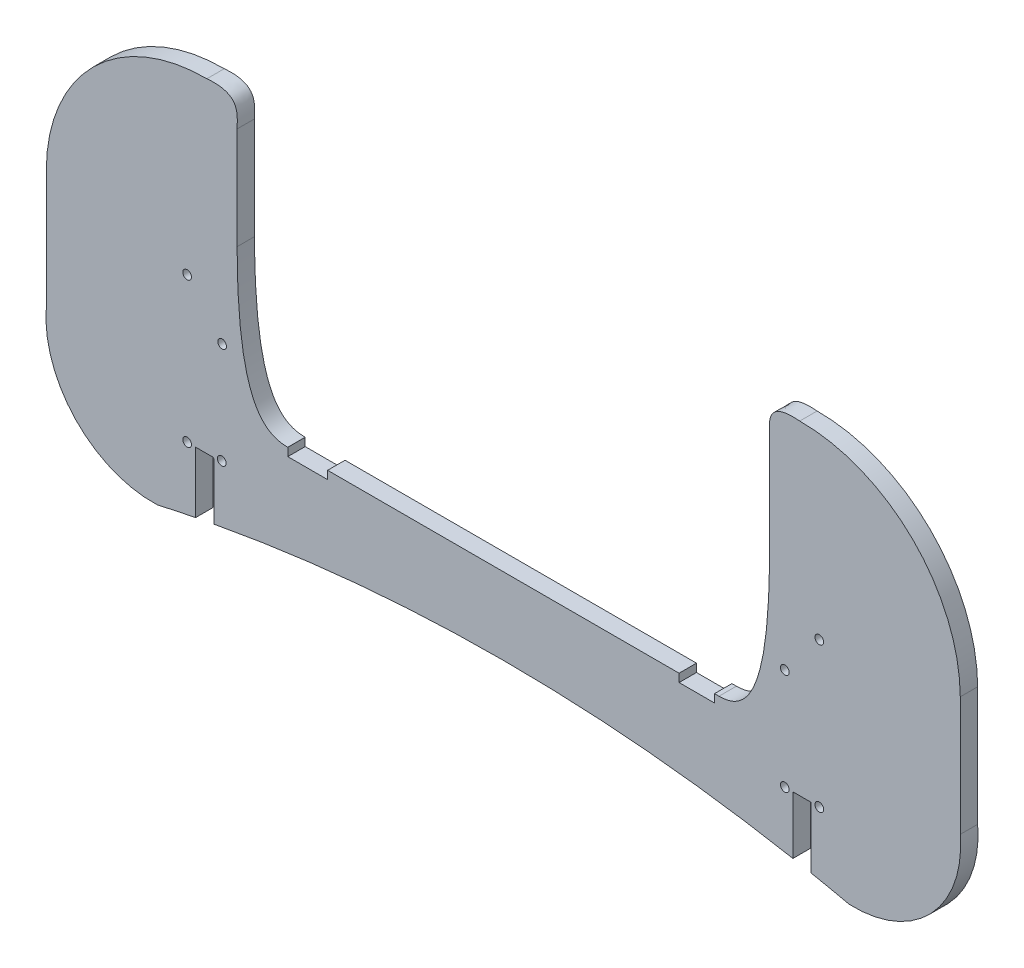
ISO-10303-21;
HEADER;
FILE_DESCRIPTION(('STEP AP214'),'2;1');
FILE_NAME('part.step','',(''),(''),'','','');
FILE_SCHEMA(('AUTOMOTIVE_DESIGN { 1 0 10303 214 1 1 1 1 }'));
ENDSEC;
DATA;
#1=APPLICATION_CONTEXT('core data for automotive mechanical design processes');
#2=APPLICATION_PROTOCOL_DEFINITION('international standard','automotive_design',2000,#1);
#3=PRODUCT_CONTEXT('',#1,'mechanical');
#4=PRODUCT('Part','Part','',(#3));
#5=PRODUCT_RELATED_PRODUCT_CATEGORY('part','',(#4));
#6=PRODUCT_DEFINITION_FORMATION('','',#4);
#7=PRODUCT_DEFINITION_CONTEXT('part definition',#1,'design');
#8=PRODUCT_DEFINITION('design','',#6,#7);
#9=PRODUCT_DEFINITION_SHAPE('','',#8);
#10=(LENGTH_UNIT() NAMED_UNIT(*) SI_UNIT(.MILLI.,.METRE.));
#11=(NAMED_UNIT(*) PLANE_ANGLE_UNIT() SI_UNIT($,.RADIAN.));
#12=(NAMED_UNIT(*) SI_UNIT($,.STERADIAN.) SOLID_ANGLE_UNIT());
#13=UNCERTAINTY_MEASURE_WITH_UNIT(LENGTH_MEASURE(1.E-05),#10,'distance_accuracy_value','');
#14=(GEOMETRIC_REPRESENTATION_CONTEXT(3) GLOBAL_UNCERTAINTY_ASSIGNED_CONTEXT((#13)) GLOBAL_UNIT_ASSIGNED_CONTEXT((#10,
#11,#12)) REPRESENTATION_CONTEXT('',''));
#15=CARTESIAN_POINT('',(0.,0.,0.));
#16=DIRECTION('',(0.,0.,1.));
#17=DIRECTION('',(1.,0.,0.));
#18=AXIS2_PLACEMENT_3D('',#15,#16,#17);
#19=CARTESIAN_POINT('',(198.055413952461,-394.813532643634,6.));
#20=DIRECTION('',(0.,0.,-1.));
#21=DIRECTION('',(-1.,0.,0.));
#22=AXIS2_PLACEMENT_3D('',#19,#20,#21);
#23=CYLINDRICAL_SURFACE('',#22,544.505274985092);
#24=DIRECTION('',(0.,0.,-1.));
#25=VECTOR('',#24,1.);
#26=CARTESIAN_POINT('',(91.9082825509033,139.245247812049,6.));
#27=LINE('',#26,#25);
#28=CARTESIAN_POINT('',(91.9082825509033,139.245247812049,6.));
#29=VERTEX_POINT('',#28);
#30=CARTESIAN_POINT('',(91.9082825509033,139.245247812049,0.));
#31=VERTEX_POINT('',#30);
#32=EDGE_CURVE('E312',#29,#31,#27,.T.);
#33=ORIENTED_EDGE('',*,*,#32,.F.);
#34=CARTESIAN_POINT('',(198.055413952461,-394.813532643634,6.));
#35=DIRECTION('',(0.,0.,1.));
#36=DIRECTION('',(1.,0.,0.));
#37=AXIS2_PLACEMENT_3D('',#34,#35,#36);
#38=CIRCLE('',#37,544.505274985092);
#39=CARTESIAN_POINT('',(78.7264462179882,136.455318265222,6.));
#40=VERTEX_POINT('',#39);
#41=EDGE_CURVE('E302',#40,#29,#38,.F.);
#42=ORIENTED_EDGE('',*,*,#41,.F.);
#43=DIRECTION('',(0.,0.,-1.));
#44=VECTOR('',#43,1.);
#45=CARTESIAN_POINT('',(78.7264462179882,136.455318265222,6.));
#46=LINE('',#45,#44);
#47=CARTESIAN_POINT('',(78.7264462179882,136.455318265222,0.));
#48=VERTEX_POINT('',#47);
#49=EDGE_CURVE('E566',#40,#48,#46,.T.);
#50=ORIENTED_EDGE('',*,*,#49,.T.);
#51=CARTESIAN_POINT('',(198.055413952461,-394.813532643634,0.));
#52=DIRECTION('',(0.,0.,1.));
#53=DIRECTION('',(1.,0.,0.));
#54=AXIS2_PLACEMENT_3D('',#51,#52,#53);
#55=CIRCLE('',#54,544.505274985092);
#56=EDGE_CURVE('E526',#48,#31,#55,.F.);
#57=ORIENTED_EDGE('',*,*,#56,.T.);
#58=EDGE_LOOP('',(#33,#42,#50,#57));
#59=FACE_BOUND('',#58,.T.);
#60=ADVANCED_FACE('F36',(#59),#23,.F.);
#61=DIRECTION('',(0.,0.,-1.));
#62=VECTOR('',#61,1.);
#63=CARTESIAN_POINT('',(98.2075926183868,140.458741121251,6.));
#64=LINE('',#63,#62);
#65=CARTESIAN_POINT('',(98.2075926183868,140.458741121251,6.));
#66=VERTEX_POINT('',#65);
#67=CARTESIAN_POINT('',(98.2075926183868,140.458741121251,0.));
#68=VERTEX_POINT('',#67);
#69=EDGE_CURVE('E314',#66,#68,#64,.T.);
#70=ORIENTED_EDGE('',*,*,#69,.T.);
#71=CARTESIAN_POINT('',(198.028200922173,149.691742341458,0.));
#72=VERTEX_POINT('',#71);
#73=EDGE_CURVE('E692',#68,#72,#55,.F.);
#74=ORIENTED_EDGE('',*,*,#73,.T.);
#75=DIRECTION('',(0.,0.,-1.));
#76=VECTOR('',#75,1.);
#77=CARTESIAN_POINT('',(198.028200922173,149.691742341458,6.));
#78=LINE('',#77,#76);
#79=CARTESIAN_POINT('',(198.028200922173,149.691742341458,6.));
#80=VERTEX_POINT('',#79);
#81=EDGE_CURVE('E568',#80,#72,#78,.T.);
#82=ORIENTED_EDGE('',*,*,#81,.F.);
#83=EDGE_CURVE('E451',#66,#80,#38,.F.);
#84=ORIENTED_EDGE('',*,*,#83,.F.);
#85=EDGE_LOOP('',(#70,#74,#82,#84));
#86=FACE_BOUND('',#85,.T.);
#87=ADVANCED_FACE('F517',(#86),#23,.F.);
#88=CARTESIAN_POINT('',(0.,0.,6.));
#89=DIRECTION('',(0.,0.,1.));
#90=DIRECTION('',(1.,0.,0.));
#91=AXIS2_PLACEMENT_3D('',#88,#89,#90);
#92=PLANE('',#91);
#93=CARTESIAN_POINT('',(88.9934994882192,160.366322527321,6.));
#94=DIRECTION('',(0.,0.,1.));
#95=DIRECTION('',(1.,0.,0.));
#96=AXIS2_PLACEMENT_3D('',#93,#94,#95);
#97=CIRCLE('',#96,1.5);
#98=CARTESIAN_POINT('',(90.4934994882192,160.366322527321,6.));
#99=VERTEX_POINT('',#98);
#100=EDGE_CURVE('E439',#99,#99,#97,.T.);
#101=ORIENTED_EDGE('',*,*,#100,.F.);
#102=EDGE_LOOP('',(#101));
#103=FACE_BOUND('',#102,.T.);
#104=CARTESIAN_POINT('',(88.9934994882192,210.366322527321,6.));
#105=DIRECTION('',(0.,0.,1.));
#106=DIRECTION('',(1.,0.,0.));
#107=AXIS2_PLACEMENT_3D('',#104,#105,#106);
#108=CIRCLE('',#107,1.49999999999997);
#109=CARTESIAN_POINT('',(90.4934994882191,210.366322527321,6.));
#110=VERTEX_POINT('',#109);
#111=EDGE_CURVE('E436',#110,#110,#108,.T.);
#112=ORIENTED_EDGE('',*,*,#111,.F.);
#113=EDGE_LOOP('',(#112));
#114=FACE_BOUND('',#113,.T.);
#115=CARTESIAN_POINT('',(307.062902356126,160.366322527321,6.));
#116=DIRECTION('',(0.,0.,1.));
#117=DIRECTION('',(1.,0.,0.));
#118=AXIS2_PLACEMENT_3D('',#115,#116,#117);
#119=CIRCLE('',#118,1.49999999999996);
#120=CARTESIAN_POINT('',(308.562902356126,160.366322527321,6.));
#121=VERTEX_POINT('',#120);
#122=EDGE_CURVE('E433',#121,#121,#119,.T.);
#123=ORIENTED_EDGE('',*,*,#122,.F.);
#124=EDGE_LOOP('',(#123));
#125=FACE_BOUND('',#124,.T.);
#126=CARTESIAN_POINT('',(307.062902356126,210.366322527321,6.));
#127=DIRECTION('',(0.,0.,1.));
#128=DIRECTION('',(1.,0.,0.));
#129=AXIS2_PLACEMENT_3D('',#126,#127,#128);
#130=CIRCLE('',#129,1.49999999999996);
#131=CARTESIAN_POINT('',(308.562902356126,210.366322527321,6.));
#132=VERTEX_POINT('',#131);
#133=EDGE_CURVE('E430',#132,#132,#130,.T.);
#134=ORIENTED_EDGE('',*,*,#133,.F.);
#135=EDGE_LOOP('',(#134));
#136=FACE_BOUND('',#135,.T.);
#137=CARTESIAN_POINT('',(295.162902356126,160.366322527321,6.));
#138=DIRECTION('',(0.,0.,1.));
#139=DIRECTION('',(1.,0.,0.));
#140=AXIS2_PLACEMENT_3D('',#137,#138,#139);
#141=CIRCLE('',#140,1.49999999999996);
#142=CARTESIAN_POINT('',(296.662902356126,160.366322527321,6.));
#143=VERTEX_POINT('',#142);
#144=EDGE_CURVE('E427',#143,#143,#141,.T.);
#145=ORIENTED_EDGE('',*,*,#144,.F.);
#146=EDGE_LOOP('',(#145));
#147=FACE_BOUND('',#146,.T.);
#148=CARTESIAN_POINT('',(100.931923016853,160.710349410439,6.));
#149=DIRECTION('',(0.,0.,1.));
#150=DIRECTION('',(1.,0.,0.));
#151=AXIS2_PLACEMENT_3D('',#148,#149,#150);
#152=CIRCLE('',#151,1.49999999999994);
#153=CARTESIAN_POINT('',(102.431923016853,160.710349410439,6.));
#154=VERTEX_POINT('',#153);
#155=EDGE_CURVE('E424',#154,#154,#152,.T.);
#156=ORIENTED_EDGE('',*,*,#155,.F.);
#157=EDGE_LOOP('',(#156));
#158=FACE_BOUND('',#157,.T.);
#159=CARTESIAN_POINT('',(101.055908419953,195.710129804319,6.));
#160=DIRECTION('',(0.,0.,1.));
#161=DIRECTION('',(1.,0.,0.));
#162=AXIS2_PLACEMENT_3D('',#159,#160,#161);
#163=CIRCLE('',#162,1.49999999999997);
#164=CARTESIAN_POINT('',(102.555908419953,195.710129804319,6.));
#165=VERTEX_POINT('',#164);
#166=EDGE_CURVE('E421',#165,#165,#163,.T.);
#167=ORIENTED_EDGE('',*,*,#166,.F.);
#168=EDGE_LOOP('',(#167));
#169=FACE_BOUND('',#168,.T.);
#170=CARTESIAN_POINT('',(295.162902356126,195.366322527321,6.));
#171=DIRECTION('',(0.,0.,1.));
#172=DIRECTION('',(1.,0.,0.));
#173=AXIS2_PLACEMENT_3D('',#170,#171,#172);
#174=CIRCLE('',#173,1.49999999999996);
#175=CARTESIAN_POINT('',(296.662902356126,195.366322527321,6.));
#176=VERTEX_POINT('',#175);
#177=EDGE_CURVE('E418',#176,#176,#174,.T.);
#178=ORIENTED_EDGE('',*,*,#177,.F.);
#179=EDGE_LOOP('',(#178));
#180=FACE_BOUND('',#179,.T.);
#181=ORIENTED_EDGE('',*,*,#41,.T.);
#182=DIRECTION('',(0.000569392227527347,-0.999999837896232,0.));
#183=VECTOR('',#182,1.);
#184=CARTESIAN_POINT('',(91.9875379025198,0.0523769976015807,6.));
#185=LINE('',#184,#183);
#186=CARTESIAN_POINT('',(91.8962907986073,160.305862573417,6.));
#187=VERTEX_POINT('',#186);
#188=EDGE_CURVE('E283',#187,#29,#185,.T.);
#189=ORIENTED_EDGE('',*,*,#188,.F.);
#190=DIRECTION('',(0.999999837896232,0.000569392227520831,0.));
#191=VECTOR('',#190,1.);
#192=CARTESIAN_POINT('',(-0.0912471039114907,160.253485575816,6.));
#193=LINE('',#192,#191);
#194=CARTESIAN_POINT('',(98.1102674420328,160.309400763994,6.));
#195=VERTEX_POINT('',#194);
#196=EDGE_CURVE('E291',#187,#195,#193,.T.);
#197=ORIENTED_EDGE('',*,*,#196,.T.);
#198=CARTESIAN_POINT('',(100.931923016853,160.710349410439,6.));
#199=DIRECTION('',(0.,0.,-1.));
#200=DIRECTION('',(-1.,0.,0.));
#201=AXIS2_PLACEMENT_3D('',#198,#199,#200);
#202=CIRCLE('',#201,2.85);
#203=CARTESIAN_POINT('',(98.1965170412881,159.910315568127,6.));
#204=VERTEX_POINT('',#203);
#205=EDGE_CURVE('E297',#195,#204,#202,.F.);
#206=ORIENTED_EDGE('',*,*,#205,.T.);
#207=DIRECTION('',(-0.000569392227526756,0.999999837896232,0.));
#208=VECTOR('',#207,1.);
#209=CARTESIAN_POINT('',(98.287536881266,0.0559641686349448,6.));
#210=LINE('',#209,#208);
#211=EDGE_CURVE('E288',#66,#204,#210,.T.);
#212=ORIENTED_EDGE('',*,*,#211,.F.);
#213=ORIENTED_EDGE('',*,*,#83,.T.);
#214=DIRECTION('',(1.,0.,0.));
#215=VECTOR('',#214,1.);
#216=CARTESIAN_POINT('',(0.,149.691742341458,6.));
#217=LINE('',#216,#215);
#218=CARTESIAN_POINT('',(198.08262698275,149.691742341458,6.));
#219=VERTEX_POINT('',#218);
#220=EDGE_CURVE('E453',#80,#219,#217,.T.);
#221=ORIENTED_EDGE('',*,*,#220,.T.);
#222=CARTESIAN_POINT('',(297.962902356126,140.447607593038,6.));
#223=VERTEX_POINT('',#222);
#224=EDGE_CURVE('E454',#219,#223,#38,.F.);
#225=ORIENTED_EDGE('',*,*,#224,.T.);
#226=DIRECTION('',(0.,1.,0.));
#227=VECTOR('',#226,1.);
#228=CARTESIAN_POINT('',(297.962902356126,0.,6.));
#229=LINE('',#228,#227);
#230=CARTESIAN_POINT('',(297.962902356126,159.834815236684,6.));
#231=VERTEX_POINT('',#230);
#232=EDGE_CURVE('E321',#223,#231,#229,.T.);
#233=ORIENTED_EDGE('',*,*,#232,.T.);
#234=CARTESIAN_POINT('',(295.162902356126,160.366322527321,6.));
#235=DIRECTION('',(0.,0.,-1.));
#236=DIRECTION('',(-1.,0.,0.));
#237=AXIS2_PLACEMENT_3D('',#234,#235,#236);
#238=CIRCLE('',#237,2.85000000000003);
#239=CARTESIAN_POINT('',(298.012902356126,160.366322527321,6.));
#240=VERTEX_POINT('',#239);
#241=EDGE_CURVE('E324',#231,#240,#238,.F.);
#242=ORIENTED_EDGE('',*,*,#241,.T.);
#243=DIRECTION('',(-1.,0.,0.));
#244=VECTOR('',#243,1.);
#245=CARTESIAN_POINT('',(-1.41303479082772E-12,160.366322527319,6.));
#246=LINE('',#245,#244);
#247=CARTESIAN_POINT('',(304.212902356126,160.366322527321,6.));
#248=VERTEX_POINT('',#247);
#249=EDGE_CURVE('E328',#248,#240,#246,.T.);
#250=ORIENTED_EDGE('',*,*,#249,.F.);
#251=CARTESIAN_POINT('',(307.062902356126,160.366322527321,6.));
#252=DIRECTION('',(0.,0.,-1.));
#253=DIRECTION('',(-1.,0.,0.));
#254=AXIS2_PLACEMENT_3D('',#251,#252,#253);
#255=CIRCLE('',#254,2.85000000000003);
#256=CARTESIAN_POINT('',(304.262902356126,159.834815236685,6.));
#257=VERTEX_POINT('',#256);
#258=EDGE_CURVE('E330',#248,#257,#255,.F.);
#259=ORIENTED_EDGE('',*,*,#258,.T.);
#260=DIRECTION('',(0.,-1.,0.));
#261=VECTOR('',#260,1.);
#262=CARTESIAN_POINT('',(304.262902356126,0.,6.));
#263=LINE('',#262,#261);
#264=CARTESIAN_POINT('',(304.262902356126,139.233247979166,6.));
#265=VERTEX_POINT('',#264);
#266=EDGE_CURVE('E333',#257,#265,#263,.T.);
#267=ORIENTED_EDGE('',*,*,#266,.T.);
#268=CARTESIAN_POINT('',(317.384381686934,136.455318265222,6.));
#269=VERTEX_POINT('',#268);
#270=EDGE_CURVE('E456',#265,#269,#38,.F.);
#271=ORIENTED_EDGE('',*,*,#270,.T.);
#272=CARTESIAN_POINT('',(318.883765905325,173.374932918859,6.));
#273=DIRECTION('',(0.,0.,1.));
#274=DIRECTION('',(1.,0.,0.));
#275=AXIS2_PLACEMENT_3D('',#272,#273,#274);
#276=CIRCLE('',#275,36.9500487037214);
#277=CARTESIAN_POINT('',(355.700328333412,176.512898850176,6.));
#278=VERTEX_POINT('',#277);
#279=EDGE_CURVE('E457',#278,#269,#276,.F.);
#280=ORIENTED_EDGE('',*,*,#279,.F.);
#281=DIRECTION('',(0.,-1.,0.));
#282=VECTOR('',#281,1.);
#283=CARTESIAN_POINT('',(355.700328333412,0.,6.));
#284=LINE('',#283,#282);
#285=CARTESIAN_POINT('',(355.700328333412,217.615459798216,6.));
#286=VERTEX_POINT('',#285);
#287=EDGE_CURVE('E460',#286,#278,#284,.T.);
#288=ORIENTED_EDGE('',*,*,#287,.F.);
#289=CARTESIAN_POINT('',(300.621130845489,217.223013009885,6.));
#290=DIRECTION('',(0.,0.,1.));
#291=DIRECTION('',(1.,0.,0.));
#292=AXIS2_PLACEMENT_3D('',#289,#290,#291);
#293=CIRCLE('',#292,55.0805955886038);
#294=CARTESIAN_POINT('',(300.316369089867,272.30276546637,6.));
#295=VERTEX_POINT('',#294);
#296=EDGE_CURVE('E463',#286,#295,#293,.T.);
#297=ORIENTED_EDGE('',*,*,#296,.T.);
#298=CARTESIAN_POINT('',(289.86656545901,262.549615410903,6.));
#299=CARTESIAN_POINT('',(289.86656545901,266.729536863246,6.));
#300=CARTESIAN_POINT('',(288.473258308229,273.347745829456,6.));
#301=CARTESIAN_POINT('',(300.316369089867,272.30276546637,6.));
#302=B_SPLINE_CURVE_WITH_KNOTS('',3,(#298,#299,#300,#301),.UNSPECIFIED.,.F.,.F.,(4,4),(14.,15.),.UNSPECIFIED.);
#303=CARTESIAN_POINT('',(289.86656545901,262.549615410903,6.));
#304=VERTEX_POINT('',#303);
#305=EDGE_CURVE('E465',#304,#295,#302,.T.);
#306=ORIENTED_EDGE('',*,*,#305,.F.);
#307=DIRECTION('',(0.,1.,0.));
#308=VECTOR('',#307,1.);
#309=CARTESIAN_POINT('',(289.86656545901,0.,6.));
#310=LINE('',#309,#308);
#311=CARTESIAN_POINT('',(289.86656545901,227.368609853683,6.));
#312=VERTEX_POINT('',#311);
#313=EDGE_CURVE('E471',#312,#304,#310,.T.);
#314=ORIENTED_EDGE('',*,*,#313,.F.);
#315=CARTESIAN_POINT('',(272.458354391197,176.164574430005,6.));
#316=CARTESIAN_POINT('',(281.514412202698,176.165862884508,6.));
#317=CARTESIAN_POINT('',(289.872809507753,183.48156045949,6.));
#318=CARTESIAN_POINT('',(289.86656545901,227.368609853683,6.));
#319=B_SPLINE_CURVE_WITH_KNOTS('',3,(#315,#316,#317,#318),.UNSPECIFIED.,.F.,.F.,(4,4),(12.,13.),.UNSPECIFIED.);
#320=CARTESIAN_POINT('',(272.458354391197,176.164574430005,6.));
#321=VERTEX_POINT('',#320);
#322=EDGE_CURVE('E755',#321,#312,#319,.T.);
#323=ORIENTED_EDGE('',*,*,#322,.F.);
#324=DIRECTION('',(0.999999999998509,1.72717519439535E-06,0.));
#325=VECTOR('',#324,1.);
#326=CARTESIAN_POINT('',(-0.000304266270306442,176.164103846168,6.));
#327=LINE('',#326,#325);
#328=CARTESIAN_POINT('',(270.910848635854,176.164571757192,6.));
#329=VERTEX_POINT('',#328);
#330=EDGE_CURVE('E753',#329,#321,#327,.T.);
#331=ORIENTED_EDGE('',*,*,#330,.F.);
#332=DIRECTION('',(0.,1.,0.));
#333=VECTOR('',#332,1.);
#334=CARTESIAN_POINT('',(270.910848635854,0.,6.));
#335=LINE('',#334,#333);
#336=CARTESIAN_POINT('',(270.910848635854,173.369451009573,6.));
#337=VERTEX_POINT('',#336);
#338=EDGE_CURVE('E750',#337,#329,#335,.T.);
#339=ORIENTED_EDGE('',*,*,#338,.F.);
#340=DIRECTION('',(1.,0.,0.));
#341=VECTOR('',#340,1.);
#342=CARTESIAN_POINT('',(0.,173.369451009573,6.));
#343=LINE('',#342,#341);
#344=CARTESIAN_POINT('',(258.695822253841,173.369451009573,6.));
#345=VERTEX_POINT('',#344);
#346=EDGE_CURVE('E747',#345,#337,#343,.T.);
#347=ORIENTED_EDGE('',*,*,#346,.F.);
#348=DIRECTION('',(0.,-1.,0.));
#349=VECTOR('',#348,1.);
#350=CARTESIAN_POINT('',(258.695822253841,0.,6.));
#351=LINE('',#350,#349);
#352=CARTESIAN_POINT('',(258.695822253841,176.1645693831,6.));
#353=VERTEX_POINT('',#352);
#354=EDGE_CURVE('E744',#353,#345,#351,.T.);
#355=ORIENTED_EDGE('',*,*,#354,.F.);
#356=DIRECTION('',(-1.,0.,0.));
#357=VECTOR('',#356,1.);
#358=CARTESIAN_POINT('',(0.,176.1645693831,6.));
#359=LINE('',#358,#357);
#360=CARTESIAN_POINT('',(137.454358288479,176.1645693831,6.));
#361=VERTEX_POINT('',#360);
#362=EDGE_CURVE('E742',#353,#361,#359,.T.);
#363=ORIENTED_EDGE('',*,*,#362,.T.);
#364=DIRECTION('',(0.,-1.,0.));
#365=VECTOR('',#364,1.);
#366=CARTESIAN_POINT('',(137.454358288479,0.,6.));
#367=LINE('',#366,#365);
#368=CARTESIAN_POINT('',(137.454358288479,173.369451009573,6.));
#369=VERTEX_POINT('',#368);
#370=EDGE_CURVE('E740',#361,#369,#367,.T.);
#371=ORIENTED_EDGE('',*,*,#370,.T.);
#372=DIRECTION('',(-1.,0.,0.));
#373=VECTOR('',#372,1.);
#374=CARTESIAN_POINT('',(0.,173.369451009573,6.));
#375=LINE('',#374,#373);
#376=CARTESIAN_POINT('',(123.711685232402,173.369451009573,6.));
#377=VERTEX_POINT('',#376);
#378=EDGE_CURVE('E738',#369,#377,#375,.T.);
#379=ORIENTED_EDGE('',*,*,#378,.T.);
#380=DIRECTION('',(0.,1.,0.));
#381=VECTOR('',#380,1.);
#382=CARTESIAN_POINT('',(123.711685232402,0.,6.));
#383=LINE('',#382,#381);
#384=CARTESIAN_POINT('',(123.711685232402,176.164571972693,6.));
#385=VERTEX_POINT('',#384);
#386=EDGE_CURVE('E736',#377,#385,#383,.T.);
#387=ORIENTED_EDGE('',*,*,#386,.T.);
#388=DIRECTION('',(-0.999999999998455,1.75767376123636E-06,0.));
#389=VECTOR('',#388,1.);
#390=CARTESIAN_POINT('',(0.000309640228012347,176.164789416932,6.));
#391=LINE('',#390,#389);
#392=CARTESIAN_POINT('',(123.660601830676,176.164572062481,6.));
#393=VERTEX_POINT('',#392);
#394=EDGE_CURVE('E731',#385,#393,#391,.T.);
#395=ORIENTED_EDGE('',*,*,#394,.T.);
#396=CARTESIAN_POINT('',(123.660601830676,176.164572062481,6.));
#397=CARTESIAN_POINT('',(114.604105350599,176.164572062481,6.));
#398=CARTESIAN_POINT('',(106.244262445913,183.479434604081,6.));
#399=CARTESIAN_POINT('',(106.244262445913,227.368609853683,6.));
#400=B_SPLINE_CURVE_WITH_KNOTS('',3,(#396,#397,#398,#399),.UNSPECIFIED.,.F.,.F.,(4,4),(12.,13.),.UNSPECIFIED.);
#401=CARTESIAN_POINT('',(106.244262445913,227.368609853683,6.));
#402=VERTEX_POINT('',#401);
#403=EDGE_CURVE('E726',#393,#402,#400,.T.);
#404=ORIENTED_EDGE('',*,*,#403,.T.);
#405=DIRECTION('',(0.,1.,0.));
#406=VECTOR('',#405,1.);
#407=CARTESIAN_POINT('',(106.244262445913,0.,6.));
#408=LINE('',#407,#406);
#409=CARTESIAN_POINT('',(106.244262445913,262.549615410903,6.));
#410=VERTEX_POINT('',#409);
#411=EDGE_CURVE('E703',#402,#410,#408,.T.);
#412=ORIENTED_EDGE('',*,*,#411,.T.);
#413=CARTESIAN_POINT('',(106.244262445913,262.549615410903,6.));
#414=CARTESIAN_POINT('',(106.244262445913,266.729536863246,6.));
#415=CARTESIAN_POINT('',(107.637569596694,273.347745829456,6.));
#416=CARTESIAN_POINT('',(95.7944588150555,272.30276546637,6.));
#417=B_SPLINE_CURVE_WITH_KNOTS('',3,(#413,#414,#415,#416),.UNSPECIFIED.,.F.,.F.,(4,4),(14.,15.),.UNSPECIFIED.);
#418=CARTESIAN_POINT('',(95.7944588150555,272.30276546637,6.));
#419=VERTEX_POINT('',#418);
#420=EDGE_CURVE('E620',#410,#419,#417,.T.);
#421=ORIENTED_EDGE('',*,*,#420,.T.);
#422=CARTESIAN_POINT('',(95.4896970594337,217.223013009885,6.));
#423=DIRECTION('',(0.,0.,1.));
#424=DIRECTION('',(1.,0.,0.));
#425=AXIS2_PLACEMENT_3D('',#422,#423,#424);
#426=CIRCLE('',#425,55.0805955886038);
#427=CARTESIAN_POINT('',(40.4104995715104,217.615459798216,6.));
#428=VERTEX_POINT('',#427);
#429=EDGE_CURVE('E443',#428,#419,#426,.F.);
#430=ORIENTED_EDGE('',*,*,#429,.F.);
#431=DIRECTION('',(0.,-1.,0.));
#432=VECTOR('',#431,1.);
#433=CARTESIAN_POINT('',(40.4104995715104,0.,6.));
#434=LINE('',#433,#432);
#435=CARTESIAN_POINT('',(40.4104995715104,176.512898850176,6.));
#436=VERTEX_POINT('',#435);
#437=EDGE_CURVE('E446',#428,#436,#434,.T.);
#438=ORIENTED_EDGE('',*,*,#437,.T.);
#439=CARTESIAN_POINT('',(77.227061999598,173.374932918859,6.));
#440=DIRECTION('',(0.,0.,1.));
#441=DIRECTION('',(1.,0.,0.));
#442=AXIS2_PLACEMENT_3D('',#439,#440,#441);
#443=CIRCLE('',#442,36.9500487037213);
#444=EDGE_CURVE('E449',#436,#40,#443,.T.);
#445=ORIENTED_EDGE('',*,*,#444,.T.);
#446=EDGE_LOOP('',(#181,#189,#197,#206,#212,#213,#221,#225,#233,#242,#250,#259,#267,#271,#280,
#288,#297,#306,#314,#323,#331,#339,#347,#355,#363,#371,#379,#387,#395,#404,#412,#421,#430,#438,#445));
#447=FACE_BOUND('',#446,.T.);
#448=ADVANCED_FACE('F300',(#103,#114,#125,#136,#147,#158,#169,#180,#447),#92,.T.);
#449=CARTESIAN_POINT('',(0.,0.,0.));
#450=DIRECTION('',(0.,0.,1.));
#451=DIRECTION('',(1.,0.,0.));
#452=AXIS2_PLACEMENT_3D('',#449,#450,#451);
#453=PLANE('',#452);
#454=CARTESIAN_POINT('',(307.062902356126,210.366322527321,0.));
#455=DIRECTION('',(0.,0.,-1.));
#456=DIRECTION('',(-1.,0.,0.));
#457=AXIS2_PLACEMENT_3D('',#454,#455,#456);
#458=CIRCLE('',#457,2.85000000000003);
#459=CARTESIAN_POINT('',(304.212902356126,210.366322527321,0.));
#460=VERTEX_POINT('',#459);
#461=EDGE_CURVE('E415',#460,#460,#458,.T.);
#462=ORIENTED_EDGE('',*,*,#461,.F.);
#463=EDGE_LOOP('',(#462));
#464=FACE_BOUND('',#463,.T.);
#465=CARTESIAN_POINT('',(295.162902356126,195.366322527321,0.));
#466=DIRECTION('',(0.,0.,-1.));
#467=DIRECTION('',(-1.,0.,0.));
#468=AXIS2_PLACEMENT_3D('',#465,#466,#467);
#469=CIRCLE('',#468,2.85000000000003);
#470=CARTESIAN_POINT('',(292.312902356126,195.366322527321,0.));
#471=VERTEX_POINT('',#470);
#472=EDGE_CURVE('E408',#471,#471,#469,.T.);
#473=ORIENTED_EDGE('',*,*,#472,.F.);
#474=EDGE_LOOP('',(#473));
#475=FACE_BOUND('',#474,.T.);
#476=CARTESIAN_POINT('',(88.9934994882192,210.366322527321,0.));
#477=DIRECTION('',(0.,0.,-1.));
#478=DIRECTION('',(-1.,0.,0.));
#479=AXIS2_PLACEMENT_3D('',#476,#477,#478);
#480=CIRCLE('',#479,2.85);
#481=CARTESIAN_POINT('',(86.1434994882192,210.366322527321,0.));
#482=VERTEX_POINT('',#481);
#483=EDGE_CURVE('E385',#482,#482,#480,.T.);
#484=ORIENTED_EDGE('',*,*,#483,.F.);
#485=EDGE_LOOP('',(#484));
#486=FACE_BOUND('',#485,.T.);
#487=CARTESIAN_POINT('',(101.055908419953,195.710129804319,0.));
#488=DIRECTION('',(0.,0.,-1.));
#489=DIRECTION('',(-1.,0.,0.));
#490=AXIS2_PLACEMENT_3D('',#487,#488,#489);
#491=CIRCLE('',#490,2.85);
#492=CARTESIAN_POINT('',(98.2059084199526,195.710129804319,0.));
#493=VERTEX_POINT('',#492);
#494=EDGE_CURVE('E378',#493,#493,#491,.T.);
#495=ORIENTED_EDGE('',*,*,#494,.F.);
#496=EDGE_LOOP('',(#495));
#497=FACE_BOUND('',#496,.T.);
#498=CARTESIAN_POINT('',(88.9934994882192,160.366322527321,0.));
#499=DIRECTION('',(0.,0.,-1.));
#500=DIRECTION('',(-1.,0.,0.));
#501=AXIS2_PLACEMENT_3D('',#498,#499,#500);
#502=CIRCLE('',#501,2.85);
#503=CARTESIAN_POINT('',(86.1434994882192,160.366322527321,0.));
#504=VERTEX_POINT('',#503);
#505=EDGE_CURVE('E345',#504,#504,#502,.T.);
#506=ORIENTED_EDGE('',*,*,#505,.F.);
#507=EDGE_LOOP('',(#506));
#508=FACE_BOUND('',#507,.T.);
#509=DIRECTION('',(-0.000569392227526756,0.999999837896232,0.));
#510=VECTOR('',#509,1.);
#511=CARTESIAN_POINT('',(98.287536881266,0.0559641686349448,0.));
#512=LINE('',#511,#510);
#513=CARTESIAN_POINT('',(98.1965170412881,159.910315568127,0.));
#514=VERTEX_POINT('',#513);
#515=EDGE_CURVE('E303',#68,#514,#512,.T.);
#516=ORIENTED_EDGE('',*,*,#515,.T.);
#517=CARTESIAN_POINT('',(100.931923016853,160.710349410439,0.));
#518=DIRECTION('',(0.,0.,-1.));
#519=DIRECTION('',(-1.,0.,0.));
#520=AXIS2_PLACEMENT_3D('',#517,#518,#519);
#521=CIRCLE('',#520,2.85);
#522=CARTESIAN_POINT('',(98.1102674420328,160.309400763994,0.));
#523=VERTEX_POINT('',#522);
#524=EDGE_CURVE('E371',#523,#514,#521,.T.);
#525=ORIENTED_EDGE('',*,*,#524,.F.);
#526=DIRECTION('',(0.999999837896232,0.000569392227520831,0.));
#527=VECTOR('',#526,1.);
#528=CARTESIAN_POINT('',(-0.0912471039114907,160.253485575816,0.));
#529=LINE('',#528,#527);
#530=CARTESIAN_POINT('',(91.8962907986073,160.305862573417,0.));
#531=VERTEX_POINT('',#530);
#532=EDGE_CURVE('E51',#531,#523,#529,.T.);
#533=ORIENTED_EDGE('',*,*,#532,.F.);
#534=DIRECTION('',(0.000569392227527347,-0.999999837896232,0.));
#535=VECTOR('',#534,1.);
#536=CARTESIAN_POINT('',(91.9875379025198,0.0523769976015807,0.));
#537=LINE('',#536,#535);
#538=EDGE_CURVE('E286',#531,#31,#537,.T.);
#539=ORIENTED_EDGE('',*,*,#538,.T.);
#540=ORIENTED_EDGE('',*,*,#56,.F.);
#541=CARTESIAN_POINT('',(77.227061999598,173.374932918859,0.));
#542=DIRECTION('',(0.,0.,1.));
#543=DIRECTION('',(1.,0.,0.));
#544=AXIS2_PLACEMENT_3D('',#541,#542,#543);
#545=CIRCLE('',#544,36.9500487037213);
#546=CARTESIAN_POINT('',(40.4104995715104,176.512898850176,0.));
#547=VERTEX_POINT('',#546);
#548=EDGE_CURVE('E693',#547,#48,#545,.T.);
#549=ORIENTED_EDGE('',*,*,#548,.F.);
#550=DIRECTION('',(0.,-1.,0.));
#551=VECTOR('',#550,1.);
#552=CARTESIAN_POINT('',(40.4104995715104,0.,0.));
#553=LINE('',#552,#551);
#554=CARTESIAN_POINT('',(40.4104995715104,217.615459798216,0.));
#555=VERTEX_POINT('',#554);
#556=EDGE_CURVE('E695',#555,#547,#553,.T.);
#557=ORIENTED_EDGE('',*,*,#556,.F.);
#558=CARTESIAN_POINT('',(95.4896970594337,217.223013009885,0.));
#559=DIRECTION('',(0.,0.,1.));
#560=DIRECTION('',(1.,0.,0.));
#561=AXIS2_PLACEMENT_3D('',#558,#559,#560);
#562=CIRCLE('',#561,55.0805955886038);
#563=CARTESIAN_POINT('',(95.7944588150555,272.30276546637,0.));
#564=VERTEX_POINT('',#563);
#565=EDGE_CURVE('E442',#555,#564,#562,.F.);
#566=ORIENTED_EDGE('',*,*,#565,.T.);
#567=CARTESIAN_POINT('',(106.244262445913,262.549615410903,0.));
#568=CARTESIAN_POINT('',(106.244262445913,266.729536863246,0.));
#569=CARTESIAN_POINT('',(107.637569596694,273.347745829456,0.));
#570=CARTESIAN_POINT('',(95.7944588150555,272.30276546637,0.));
#571=B_SPLINE_CURVE_WITH_KNOTS('',3,(#567,#568,#569,#570),.UNSPECIFIED.,.F.,.F.,(4,4),(14.,15.),.UNSPECIFIED.);
#572=CARTESIAN_POINT('',(106.244262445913,262.549615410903,0.));
#573=VERTEX_POINT('',#572);
#574=EDGE_CURVE('E447',#573,#564,#571,.T.);
#575=ORIENTED_EDGE('',*,*,#574,.F.);
#576=DIRECTION('',(0.,1.,0.));
#577=VECTOR('',#576,1.);
#578=CARTESIAN_POINT('',(106.244262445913,0.,0.));
#579=LINE('',#578,#577);
#580=CARTESIAN_POINT('',(106.244262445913,227.368609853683,0.));
#581=VERTEX_POINT('',#580);
#582=EDGE_CURVE('E625',#581,#573,#579,.T.);
#583=ORIENTED_EDGE('',*,*,#582,.F.);
#584=CARTESIAN_POINT('',(123.660601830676,176.164572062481,0.));
#585=CARTESIAN_POINT('',(114.604105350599,176.164572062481,0.));
#586=CARTESIAN_POINT('',(106.244262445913,183.479434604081,0.));
#587=CARTESIAN_POINT('',(106.244262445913,227.368609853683,0.));
#588=B_SPLINE_CURVE_WITH_KNOTS('',3,(#584,#585,#586,#587),.UNSPECIFIED.,.F.,.F.,(4,4),(12.,13.),.UNSPECIFIED.);
#589=CARTESIAN_POINT('',(123.660601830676,176.164572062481,0.));
#590=VERTEX_POINT('',#589);
#591=EDGE_CURVE('E630',#590,#581,#588,.T.);
#592=ORIENTED_EDGE('',*,*,#591,.F.);
#593=DIRECTION('',(-0.999999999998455,1.75767376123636E-06,0.));
#594=VECTOR('',#593,1.);
#595=CARTESIAN_POINT('',(0.000309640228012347,176.164789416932,0.));
#596=LINE('',#595,#594);
#597=CARTESIAN_POINT('',(123.711685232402,176.164571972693,0.));
#598=VERTEX_POINT('',#597);
#599=EDGE_CURVE('E634',#598,#590,#596,.T.);
#600=ORIENTED_EDGE('',*,*,#599,.F.);
#601=DIRECTION('',(0.,1.,0.));
#602=VECTOR('',#601,1.);
#603=CARTESIAN_POINT('',(123.711685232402,0.,0.));
#604=LINE('',#603,#602);
#605=CARTESIAN_POINT('',(123.711685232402,173.369451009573,0.));
#606=VERTEX_POINT('',#605);
#607=EDGE_CURVE('E639',#606,#598,#604,.T.);
#608=ORIENTED_EDGE('',*,*,#607,.F.);
#609=DIRECTION('',(-1.,0.,0.));
#610=VECTOR('',#609,1.);
#611=CARTESIAN_POINT('',(0.,173.369451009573,0.));
#612=LINE('',#611,#610);
#613=CARTESIAN_POINT('',(137.454358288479,173.369451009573,0.));
#614=VERTEX_POINT('',#613);
#615=EDGE_CURVE('E641',#614,#606,#612,.T.);
#616=ORIENTED_EDGE('',*,*,#615,.F.);
#617=DIRECTION('',(0.,-1.,0.));
#618=VECTOR('',#617,1.);
#619=CARTESIAN_POINT('',(137.454358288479,0.,0.));
#620=LINE('',#619,#618);
#621=CARTESIAN_POINT('',(137.454358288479,176.1645693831,0.));
#622=VERTEX_POINT('',#621);
#623=EDGE_CURVE('E643',#622,#614,#620,.T.);
#624=ORIENTED_EDGE('',*,*,#623,.F.);
#625=DIRECTION('',(-1.,0.,0.));
#626=VECTOR('',#625,1.);
#627=CARTESIAN_POINT('',(0.,176.1645693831,0.));
#628=LINE('',#627,#626);
#629=CARTESIAN_POINT('',(258.695822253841,176.1645693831,0.));
#630=VERTEX_POINT('',#629);
#631=EDGE_CURVE('E645',#630,#622,#628,.T.);
#632=ORIENTED_EDGE('',*,*,#631,.F.);
#633=DIRECTION('',(0.,-1.,0.));
#634=VECTOR('',#633,1.);
#635=CARTESIAN_POINT('',(258.695822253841,0.,0.));
#636=LINE('',#635,#634);
#637=CARTESIAN_POINT('',(258.695822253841,173.369451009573,0.));
#638=VERTEX_POINT('',#637);
#639=EDGE_CURVE('E647',#630,#638,#636,.T.);
#640=ORIENTED_EDGE('',*,*,#639,.T.);
#641=DIRECTION('',(1.,0.,0.));
#642=VECTOR('',#641,1.);
#643=CARTESIAN_POINT('',(0.,173.369451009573,0.));
#644=LINE('',#643,#642);
#645=CARTESIAN_POINT('',(270.910848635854,173.369451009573,0.));
#646=VERTEX_POINT('',#645);
#647=EDGE_CURVE('E650',#638,#646,#644,.T.);
#648=ORIENTED_EDGE('',*,*,#647,.T.);
#649=DIRECTION('',(0.,1.,0.));
#650=VECTOR('',#649,1.);
#651=CARTESIAN_POINT('',(270.910848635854,0.,0.));
#652=LINE('',#651,#650);
#653=CARTESIAN_POINT('',(270.910848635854,176.164571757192,0.));
#654=VERTEX_POINT('',#653);
#655=EDGE_CURVE('E653',#646,#654,#652,.T.);
#656=ORIENTED_EDGE('',*,*,#655,.T.);
#657=DIRECTION('',(0.999999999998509,1.72717519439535E-06,0.));
#658=VECTOR('',#657,1.);
#659=CARTESIAN_POINT('',(-0.000304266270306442,176.164103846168,0.));
#660=LINE('',#659,#658);
#661=CARTESIAN_POINT('',(272.458354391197,176.164574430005,0.));
#662=VERTEX_POINT('',#661);
#663=EDGE_CURVE('E656',#654,#662,#660,.T.);
#664=ORIENTED_EDGE('',*,*,#663,.T.);
#665=CARTESIAN_POINT('',(272.458354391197,176.164574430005,0.));
#666=CARTESIAN_POINT('',(281.514412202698,176.165862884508,0.));
#667=CARTESIAN_POINT('',(289.872809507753,183.48156045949,0.));
#668=CARTESIAN_POINT('',(289.86656545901,227.368609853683,0.));
#669=B_SPLINE_CURVE_WITH_KNOTS('',3,(#665,#666,#667,#668),.UNSPECIFIED.,.F.,.F.,(4,4),(12.,13.),.UNSPECIFIED.);
#670=CARTESIAN_POINT('',(289.86656545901,227.368609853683,0.));
#671=VERTEX_POINT('',#670);
#672=EDGE_CURVE('E659',#662,#671,#669,.T.);
#673=ORIENTED_EDGE('',*,*,#672,.T.);
#674=DIRECTION('',(0.,1.,0.));
#675=VECTOR('',#674,1.);
#676=CARTESIAN_POINT('',(289.86656545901,0.,0.));
#677=LINE('',#676,#675);
#678=CARTESIAN_POINT('',(289.86656545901,262.549615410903,0.));
#679=VERTEX_POINT('',#678);
#680=EDGE_CURVE('E664',#671,#679,#677,.T.);
#681=ORIENTED_EDGE('',*,*,#680,.T.);
#682=CARTESIAN_POINT('',(289.86656545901,262.549615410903,0.));
#683=CARTESIAN_POINT('',(289.86656545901,266.729536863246,0.));
#684=CARTESIAN_POINT('',(288.473258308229,273.347745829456,0.));
#685=CARTESIAN_POINT('',(300.316369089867,272.30276546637,0.));
#686=B_SPLINE_CURVE_WITH_KNOTS('',3,(#682,#683,#684,#685),.UNSPECIFIED.,.F.,.F.,(4,4),(14.,15.),.UNSPECIFIED.);
#687=CARTESIAN_POINT('',(300.316369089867,272.30276546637,0.));
#688=VERTEX_POINT('',#687);
#689=EDGE_CURVE('E670',#679,#688,#686,.T.);
#690=ORIENTED_EDGE('',*,*,#689,.T.);
#691=CARTESIAN_POINT('',(300.621130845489,217.223013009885,0.));
#692=DIRECTION('',(0.,0.,1.));
#693=DIRECTION('',(1.,0.,0.));
#694=AXIS2_PLACEMENT_3D('',#691,#692,#693);
#695=CIRCLE('',#694,55.0805955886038);
#696=CARTESIAN_POINT('',(355.700328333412,217.615459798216,0.));
#697=VERTEX_POINT('',#696);
#698=EDGE_CURVE('E675',#697,#688,#695,.T.);
#699=ORIENTED_EDGE('',*,*,#698,.F.);
#700=DIRECTION('',(0.,-1.,0.));
#701=VECTOR('',#700,1.);
#702=CARTESIAN_POINT('',(355.700328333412,0.,0.));
#703=LINE('',#702,#701);
#704=CARTESIAN_POINT('',(355.700328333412,176.512898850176,0.));
#705=VERTEX_POINT('',#704);
#706=EDGE_CURVE('E681',#697,#705,#703,.T.);
#707=ORIENTED_EDGE('',*,*,#706,.T.);
#708=CARTESIAN_POINT('',(318.883765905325,173.374932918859,0.));
#709=DIRECTION('',(0.,0.,1.));
#710=DIRECTION('',(1.,0.,0.));
#711=AXIS2_PLACEMENT_3D('',#708,#709,#710);
#712=CIRCLE('',#711,36.9500487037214);
#713=CARTESIAN_POINT('',(317.384381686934,136.455318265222,0.));
#714=VERTEX_POINT('',#713);
#715=EDGE_CURVE('E684',#705,#714,#712,.F.);
#716=ORIENTED_EDGE('',*,*,#715,.T.);
#717=CARTESIAN_POINT('',(304.262902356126,139.233247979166,0.));
#718=VERTEX_POINT('',#717);
#719=EDGE_CURVE('E690',#718,#714,#55,.F.);
#720=ORIENTED_EDGE('',*,*,#719,.F.);
#721=DIRECTION('',(0.,-1.,0.));
#722=VECTOR('',#721,1.);
#723=CARTESIAN_POINT('',(304.262902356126,0.,0.));
#724=LINE('',#723,#722);
#725=CARTESIAN_POINT('',(304.262902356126,159.834815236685,0.));
#726=VERTEX_POINT('',#725);
#727=EDGE_CURVE('E325',#726,#718,#724,.T.);
#728=ORIENTED_EDGE('',*,*,#727,.F.);
#729=CARTESIAN_POINT('',(307.062902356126,160.366322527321,0.));
#730=DIRECTION('',(0.,0.,-1.));
#731=DIRECTION('',(-1.,0.,0.));
#732=AXIS2_PLACEMENT_3D('',#729,#730,#731);
#733=CIRCLE('',#732,2.85000000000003);
#734=CARTESIAN_POINT('',(304.212902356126,160.366322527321,0.));
#735=VERTEX_POINT('',#734);
#736=EDGE_CURVE('E401',#735,#726,#733,.T.);
#737=ORIENTED_EDGE('',*,*,#736,.F.);
#738=DIRECTION('',(-1.,0.,0.));
#739=VECTOR('',#738,1.);
#740=CARTESIAN_POINT('',(-1.41303479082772E-12,160.366322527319,0.));
#741=LINE('',#740,#739);
#742=CARTESIAN_POINT('',(298.012902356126,160.366322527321,0.));
#743=VERTEX_POINT('',#742);
#744=EDGE_CURVE('E338',#735,#743,#741,.T.);
#745=ORIENTED_EDGE('',*,*,#744,.T.);
#746=CARTESIAN_POINT('',(295.162902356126,160.366322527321,0.));
#747=DIRECTION('',(0.,0.,-1.));
#748=DIRECTION('',(-1.,0.,0.));
#749=AXIS2_PLACEMENT_3D('',#746,#747,#748);
#750=CIRCLE('',#749,2.85000000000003);
#751=CARTESIAN_POINT('',(297.962902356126,159.834815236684,0.));
#752=VERTEX_POINT('',#751);
#753=EDGE_CURVE('E393',#752,#743,#750,.T.);
#754=ORIENTED_EDGE('',*,*,#753,.F.);
#755=DIRECTION('',(0.,1.,0.));
#756=VECTOR('',#755,1.);
#757=CARTESIAN_POINT('',(297.962902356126,0.,0.));
#758=LINE('',#757,#756);
#759=CARTESIAN_POINT('',(297.962902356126,140.447607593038,0.));
#760=VERTEX_POINT('',#759);
#761=EDGE_CURVE('E59',#760,#752,#758,.T.);
#762=ORIENTED_EDGE('',*,*,#761,.F.);
#763=CARTESIAN_POINT('',(198.08262698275,149.691742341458,0.));
#764=VERTEX_POINT('',#763);
#765=EDGE_CURVE('E687',#764,#760,#55,.F.);
#766=ORIENTED_EDGE('',*,*,#765,.F.);
#767=DIRECTION('',(1.,0.,0.));
#768=VECTOR('',#767,1.);
#769=CARTESIAN_POINT('',(0.,149.691742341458,0.));
#770=LINE('',#769,#768);
#771=EDGE_CURVE('E688',#72,#764,#770,.T.);
#772=ORIENTED_EDGE('',*,*,#771,.F.);
#773=ORIENTED_EDGE('',*,*,#73,.F.);
#774=EDGE_LOOP('',(#516,#525,#533,#539,#540,#549,#557,#566,#575,#583,#592,#600,#608,#616,#624,
#632,#640,#648,#656,#664,#673,#681,#690,#699,#707,#716,#720,#728,#737,#745,#754,#762,#766,#772,#773));
#775=FACE_BOUND('',#774,.T.);
#776=ADVANCED_FACE('F528',(#464,#475,#486,#497,#508,#775),#453,.F.);
#777=CARTESIAN_POINT('',(100.931923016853,160.710349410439,3.));
#778=DIRECTION('',(0.,0.,-1.));
#779=DIRECTION('',(-1.,0.,0.));
#780=AXIS2_PLACEMENT_3D('',#777,#778,#779);
#781=CYLINDRICAL_SURFACE('',#780,2.85);
#782=DIRECTION('',(0.,0.,-1.));
#783=VECTOR('',#782,1.);
#784=CARTESIAN_POINT('',(98.1965170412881,159.910315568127,3.));
#785=LINE('',#784,#783);
#786=CARTESIAN_POINT('',(98.1965170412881,159.910315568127,3.));
#787=VERTEX_POINT('',#786);
#788=EDGE_CURVE('E11',#787,#514,#785,.T.);
#789=ORIENTED_EDGE('',*,*,#788,.F.);
#790=CARTESIAN_POINT('',(100.931923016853,160.710349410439,3.));
#791=DIRECTION('',(0.,0.,-1.));
#792=DIRECTION('',(-1.,0.,0.));
#793=AXIS2_PLACEMENT_3D('',#790,#791,#792);
#794=CIRCLE('',#793,2.85);
#795=CARTESIAN_POINT('',(98.1102674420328,160.309400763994,3.));
#796=VERTEX_POINT('',#795);
#797=EDGE_CURVE('E370',#796,#787,#794,.T.);
#798=ORIENTED_EDGE('',*,*,#797,.F.);
#799=DIRECTION('',(0.,0.,-1.));
#800=VECTOR('',#799,1.);
#801=CARTESIAN_POINT('',(98.1102674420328,160.309400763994,3.));
#802=LINE('',#801,#800);
#803=EDGE_CURVE('E44',#796,#523,#802,.T.);
#804=ORIENTED_EDGE('',*,*,#803,.T.);
#805=ORIENTED_EDGE('',*,*,#524,.T.);
#806=EDGE_LOOP('',(#789,#798,#804,#805));
#807=FACE_BOUND('',#806,.T.);
#808=ADVANCED_FACE('F534',(#807),#781,.F.);
#809=ORIENTED_EDGE('',*,*,#270,.F.);
#810=DIRECTION('',(0.,0.,-1.));
#811=VECTOR('',#810,1.);
#812=CARTESIAN_POINT('',(304.262902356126,139.233247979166,6.));
#813=LINE('',#812,#811);
#814=EDGE_CURVE('E342',#265,#718,#813,.T.);
#815=ORIENTED_EDGE('',*,*,#814,.T.);
#816=ORIENTED_EDGE('',*,*,#719,.T.);
#817=DIRECTION('',(0.,0.,-1.));
#818=VECTOR('',#817,1.);
#819=CARTESIAN_POINT('',(317.384381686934,136.455318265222,6.));
#820=LINE('',#819,#818);
#821=EDGE_CURVE('E574',#269,#714,#820,.T.);
#822=ORIENTED_EDGE('',*,*,#821,.F.);
#823=EDGE_LOOP('',(#809,#815,#816,#822));
#824=FACE_BOUND('',#823,.T.);
#825=ADVANCED_FACE('F501',(#824),#23,.F.);
#826=CARTESIAN_POINT('',(295.162902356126,160.366322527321,3.));
#827=DIRECTION('',(0.,0.,-1.));
#828=DIRECTION('',(-1.,0.,0.));
#829=AXIS2_PLACEMENT_3D('',#826,#827,#828);
#830=CYLINDRICAL_SURFACE('',#829,2.85000000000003);
#831=DIRECTION('',(0.,0.,-1.));
#832=VECTOR('',#831,1.);
#833=CARTESIAN_POINT('',(298.012902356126,160.366322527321,3.));
#834=LINE('',#833,#832);
#835=CARTESIAN_POINT('',(298.012902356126,160.366322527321,3.));
#836=VERTEX_POINT('',#835);
#837=EDGE_CURVE('E539',#836,#743,#834,.T.);
#838=ORIENTED_EDGE('',*,*,#837,.F.);
#839=CARTESIAN_POINT('',(295.162902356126,160.366322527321,3.));
#840=DIRECTION('',(0.,0.,-1.));
#841=DIRECTION('',(-1.,0.,0.));
#842=AXIS2_PLACEMENT_3D('',#839,#840,#841);
#843=CIRCLE('',#842,2.85000000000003);
#844=CARTESIAN_POINT('',(297.962902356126,159.834815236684,3.));
#845=VERTEX_POINT('',#844);
#846=EDGE_CURVE('E392',#845,#836,#843,.T.);
#847=ORIENTED_EDGE('',*,*,#846,.F.);
#848=DIRECTION('',(0.,0.,-1.));
#849=VECTOR('',#848,1.);
#850=CARTESIAN_POINT('',(297.962902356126,159.834815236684,3.));
#851=LINE('',#850,#849);
#852=EDGE_CURVE('E543',#845,#752,#851,.T.);
#853=ORIENTED_EDGE('',*,*,#852,.T.);
#854=ORIENTED_EDGE('',*,*,#753,.T.);
#855=EDGE_LOOP('',(#838,#847,#853,#854));
#856=FACE_BOUND('',#855,.T.);
#857=ADVANCED_FACE('F894',(#856),#830,.F.);
#858=CARTESIAN_POINT('',(88.9934994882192,160.366322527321,10.));
#859=DIRECTION('',(0.,0.,-1.));
#860=DIRECTION('',(-1.,0.,0.));
#861=AXIS2_PLACEMENT_3D('',#858,#859,#860);
#862=CYLINDRICAL_SURFACE('',#861,1.5);
#863=ORIENTED_EDGE('',*,*,#100,.T.);
#864=EDGE_LOOP('',(#863));
#865=FACE_BOUND('',#864,.T.);
#866=CARTESIAN_POINT('',(88.9934994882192,160.366322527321,3.));
#867=DIRECTION('',(0.,0.,-1.));
#868=DIRECTION('',(-1.,0.,0.));
#869=AXIS2_PLACEMENT_3D('',#866,#867,#868);
#870=CIRCLE('',#869,1.5);
#871=CARTESIAN_POINT('',(87.4934994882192,160.366322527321,3.));
#872=VERTEX_POINT('',#871);
#873=EDGE_CURVE('E363',#872,#872,#870,.F.);
#874=ORIENTED_EDGE('',*,*,#873,.F.);
#875=EDGE_LOOP('',(#874));
#876=FACE_BOUND('',#875,.T.);
#877=ADVANCED_FACE('F884',(#865,#876),#862,.F.);
#878=CARTESIAN_POINT('',(100.931923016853,160.710349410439,10.));
#879=DIRECTION('',(0.,0.,-1.));
#880=DIRECTION('',(-1.,0.,0.));
#881=AXIS2_PLACEMENT_3D('',#878,#879,#880);
#882=CYLINDRICAL_SURFACE('',#881,1.49999999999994);
#883=ORIENTED_EDGE('',*,*,#155,.T.);
#884=EDGE_LOOP('',(#883));
#885=FACE_BOUND('',#884,.T.);
#886=CARTESIAN_POINT('',(100.931923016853,160.710349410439,3.));
#887=DIRECTION('',(0.,0.,-1.));
#888=DIRECTION('',(-1.,0.,0.));
#889=AXIS2_PLACEMENT_3D('',#886,#887,#888);
#890=CIRCLE('',#889,1.49999999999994);
#891=CARTESIAN_POINT('',(99.431923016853,160.710349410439,3.));
#892=VERTEX_POINT('',#891);
#893=EDGE_CURVE('E369',#892,#892,#890,.F.);
#894=ORIENTED_EDGE('',*,*,#893,.F.);
#895=EDGE_LOOP('',(#894));
#896=FACE_BOUND('',#895,.T.);
#897=ADVANCED_FACE('F881',(#885,#896),#882,.F.);
#898=CARTESIAN_POINT('',(101.055908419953,195.710129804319,10.));
#899=DIRECTION('',(0.,0.,-1.));
#900=DIRECTION('',(-1.,0.,0.));
#901=AXIS2_PLACEMENT_3D('',#898,#899,#900);
#902=CYLINDRICAL_SURFACE('',#901,1.49999999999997);
#903=ORIENTED_EDGE('',*,*,#166,.T.);
#904=EDGE_LOOP('',(#903));
#905=FACE_BOUND('',#904,.T.);
#906=CARTESIAN_POINT('',(101.055908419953,195.710129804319,3.));
#907=DIRECTION('',(0.,0.,-1.));
#908=DIRECTION('',(-1.,0.,0.));
#909=AXIS2_PLACEMENT_3D('',#906,#907,#908);
#910=CIRCLE('',#909,1.49999999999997);
#911=CARTESIAN_POINT('',(99.5559084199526,195.710129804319,3.));
#912=VERTEX_POINT('',#911);
#913=EDGE_CURVE('E377',#912,#912,#910,.F.);
#914=ORIENTED_EDGE('',*,*,#913,.F.);
#915=EDGE_LOOP('',(#914));
#916=FACE_BOUND('',#915,.T.);
#917=ADVANCED_FACE('F883',(#905,#916),#902,.F.);
#918=CARTESIAN_POINT('',(88.9934994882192,210.366322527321,10.));
#919=DIRECTION('',(0.,0.,-1.));
#920=DIRECTION('',(-1.,0.,0.));
#921=AXIS2_PLACEMENT_3D('',#918,#919,#920);
#922=CYLINDRICAL_SURFACE('',#921,1.49999999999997);
#923=ORIENTED_EDGE('',*,*,#111,.T.);
#924=EDGE_LOOP('',(#923));
#925=FACE_BOUND('',#924,.T.);
#926=CARTESIAN_POINT('',(88.9934994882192,210.366322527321,3.));
#927=DIRECTION('',(0.,0.,-1.));
#928=DIRECTION('',(-1.,0.,0.));
#929=AXIS2_PLACEMENT_3D('',#926,#927,#928);
#930=CIRCLE('',#929,1.49999999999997);
#931=CARTESIAN_POINT('',(87.4934994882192,210.366322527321,3.));
#932=VERTEX_POINT('',#931);
#933=EDGE_CURVE('E384',#932,#932,#930,.F.);
#934=ORIENTED_EDGE('',*,*,#933,.F.);
#935=EDGE_LOOP('',(#934));
#936=FACE_BOUND('',#935,.T.);
#937=ADVANCED_FACE('F891',(#925,#936),#922,.F.);
#938=CARTESIAN_POINT('',(295.162902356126,160.366322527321,10.));
#939=DIRECTION('',(0.,0.,-1.));
#940=DIRECTION('',(-1.,0.,0.));
#941=AXIS2_PLACEMENT_3D('',#938,#939,#940);
#942=CYLINDRICAL_SURFACE('',#941,1.49999999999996);
#943=ORIENTED_EDGE('',*,*,#144,.T.);
#944=EDGE_LOOP('',(#943));
#945=FACE_BOUND('',#944,.T.);
#946=CARTESIAN_POINT('',(295.162902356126,160.366322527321,3.));
#947=DIRECTION('',(0.,0.,-1.));
#948=DIRECTION('',(-1.,0.,0.));
#949=AXIS2_PLACEMENT_3D('',#946,#947,#948);
#950=CIRCLE('',#949,1.49999999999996);
#951=CARTESIAN_POINT('',(293.662902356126,160.366322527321,3.));
#952=VERTEX_POINT('',#951);
#953=EDGE_CURVE('E391',#952,#952,#950,.F.);
#954=ORIENTED_EDGE('',*,*,#953,.F.);
#955=EDGE_LOOP('',(#954));
#956=FACE_BOUND('',#955,.T.);
#957=ADVANCED_FACE('F899',(#945,#956),#942,.F.);
#958=CARTESIAN_POINT('',(307.062902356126,160.366322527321,10.));
#959=DIRECTION('',(0.,0.,-1.));
#960=DIRECTION('',(-1.,0.,0.));
#961=AXIS2_PLACEMENT_3D('',#958,#959,#960);
#962=CYLINDRICAL_SURFACE('',#961,1.49999999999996);
#963=ORIENTED_EDGE('',*,*,#122,.T.);
#964=EDGE_LOOP('',(#963));
#965=FACE_BOUND('',#964,.T.);
#966=CARTESIAN_POINT('',(307.062902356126,160.366322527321,3.));
#967=DIRECTION('',(0.,0.,-1.));
#968=DIRECTION('',(-1.,0.,0.));
#969=AXIS2_PLACEMENT_3D('',#966,#967,#968);
#970=CIRCLE('',#969,1.49999999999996);
#971=CARTESIAN_POINT('',(305.562902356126,160.366322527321,3.));
#972=VERTEX_POINT('',#971);
#973=EDGE_CURVE('E399',#972,#972,#970,.F.);
#974=ORIENTED_EDGE('',*,*,#973,.F.);
#975=EDGE_LOOP('',(#974));
#976=FACE_BOUND('',#975,.T.);
#977=ADVANCED_FACE('F902',(#965,#976),#962,.F.);
#978=CARTESIAN_POINT('',(295.162902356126,195.366322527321,10.));
#979=DIRECTION('',(0.,0.,-1.));
#980=DIRECTION('',(-1.,0.,0.));
#981=AXIS2_PLACEMENT_3D('',#978,#979,#980);
#982=CYLINDRICAL_SURFACE('',#981,1.49999999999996);
#983=ORIENTED_EDGE('',*,*,#177,.T.);
#984=EDGE_LOOP('',(#983));
#985=FACE_BOUND('',#984,.T.);
#986=CARTESIAN_POINT('',(295.162902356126,195.366322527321,3.));
#987=DIRECTION('',(0.,0.,-1.));
#988=DIRECTION('',(-1.,0.,0.));
#989=AXIS2_PLACEMENT_3D('',#986,#987,#988);
#990=CIRCLE('',#989,1.49999999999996);
#991=CARTESIAN_POINT('',(293.662902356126,195.366322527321,3.));
#992=VERTEX_POINT('',#991);
#993=EDGE_CURVE('E407',#992,#992,#990,.F.);
#994=ORIENTED_EDGE('',*,*,#993,.F.);
#995=EDGE_LOOP('',(#994));
#996=FACE_BOUND('',#995,.T.);
#997=ADVANCED_FACE('F906',(#985,#996),#982,.F.);
#998=CARTESIAN_POINT('',(307.062902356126,210.366322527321,10.));
#999=DIRECTION('',(0.,0.,-1.));
#1000=DIRECTION('',(-1.,0.,0.));
#1001=AXIS2_PLACEMENT_3D('',#998,#999,#1000);
#1002=CYLINDRICAL_SURFACE('',#1001,1.49999999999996);
#1003=ORIENTED_EDGE('',*,*,#133,.T.);
#1004=EDGE_LOOP('',(#1003));
#1005=FACE_BOUND('',#1004,.T.);
#1006=CARTESIAN_POINT('',(307.062902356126,210.366322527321,3.));
#1007=DIRECTION('',(0.,0.,-1.));
#1008=DIRECTION('',(-1.,0.,0.));
#1009=AXIS2_PLACEMENT_3D('',#1006,#1007,#1008);
#1010=CIRCLE('',#1009,1.49999999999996);
#1011=CARTESIAN_POINT('',(305.562902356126,210.366322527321,3.));
#1012=VERTEX_POINT('',#1011);
#1013=EDGE_CURVE('E414',#1012,#1012,#1010,.F.);
#1014=ORIENTED_EDGE('',*,*,#1013,.F.);
#1015=EDGE_LOOP('',(#1014));
#1016=FACE_BOUND('',#1015,.T.);
#1017=ADVANCED_FACE('F514',(#1005,#1016),#1002,.F.);
#1018=CARTESIAN_POINT('',(95.4896970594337,217.223013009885,6.));
#1019=DIRECTION('',(0.,0.,-1.));
#1020=DIRECTION('',(-1.,0.,0.));
#1021=AXIS2_PLACEMENT_3D('',#1018,#1019,#1020);
#1022=CYLINDRICAL_SURFACE('',#1021,55.0805955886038);
#1023=ORIENTED_EDGE('',*,*,#565,.F.);
#1024=DIRECTION('',(0.,0.,-1.));
#1025=VECTOR('',#1024,1.);
#1026=CARTESIAN_POINT('',(40.4104995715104,217.615459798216,6.));
#1027=LINE('',#1026,#1025);
#1028=EDGE_CURVE('E545',#428,#555,#1027,.T.);
#1029=ORIENTED_EDGE('',*,*,#1028,.F.);
#1030=ORIENTED_EDGE('',*,*,#429,.T.);
#1031=DIRECTION('',(0.,0.,-1.));
#1032=VECTOR('',#1031,1.);
#1033=CARTESIAN_POINT('',(95.7944588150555,272.30276546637,6.));
#1034=LINE('',#1033,#1032);
#1035=EDGE_CURVE('E618',#419,#564,#1034,.T.);
#1036=ORIENTED_EDGE('',*,*,#1035,.T.);
#1037=EDGE_LOOP('',(#1023,#1029,#1030,#1036));
#1038=FACE_BOUND('',#1037,.T.);
#1039=ADVANCED_FACE('F38',(#1038),#1022,.T.);
#1040=CARTESIAN_POINT('',(40.4104995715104,0.,6.));
#1041=DIRECTION('',(1.,0.,0.));
#1042=DIRECTION('',(0.,0.,-1.));
#1043=AXIS2_PLACEMENT_3D('',#1040,#1041,#1042);
#1044=PLANE('',#1043);
#1045=ORIENTED_EDGE('',*,*,#556,.T.);
#1046=DIRECTION('',(0.,0.,-1.));
#1047=VECTOR('',#1046,1.);
#1048=CARTESIAN_POINT('',(40.4104995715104,176.512898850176,6.));
#1049=LINE('',#1048,#1047);
#1050=EDGE_CURVE('E563',#436,#547,#1049,.T.);
#1051=ORIENTED_EDGE('',*,*,#1050,.F.);
#1052=ORIENTED_EDGE('',*,*,#437,.F.);
#1053=ORIENTED_EDGE('',*,*,#1028,.T.);
#1054=EDGE_LOOP('',(#1045,#1051,#1052,#1053));
#1055=FACE_BOUND('',#1054,.T.);
#1056=ADVANCED_FACE('F507',(#1055),#1044,.F.);
#1057=CARTESIAN_POINT('',(77.227061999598,173.374932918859,6.));
#1058=DIRECTION('',(0.,0.,-1.));
#1059=DIRECTION('',(-1.,0.,0.));
#1060=AXIS2_PLACEMENT_3D('',#1057,#1058,#1059);
#1061=CYLINDRICAL_SURFACE('',#1060,36.9500487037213);
#1062=ORIENTED_EDGE('',*,*,#548,.T.);
#1063=ORIENTED_EDGE('',*,*,#49,.F.);
#1064=ORIENTED_EDGE('',*,*,#444,.F.);
#1065=ORIENTED_EDGE('',*,*,#1050,.T.);
#1066=EDGE_LOOP('',(#1062,#1063,#1064,#1065));
#1067=FACE_BOUND('',#1066,.T.);
#1068=ADVANCED_FACE('F504',(#1067),#1061,.T.);
#1069=CARTESIAN_POINT('',(0.,149.691742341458,6.));
#1070=DIRECTION('',(0.,1.,0.));
#1071=DIRECTION('',(0.,0.,1.));
#1072=AXIS2_PLACEMENT_3D('',#1069,#1070,#1071);
#1073=PLANE('',#1072);
#1074=ORIENTED_EDGE('',*,*,#771,.T.);
#1075=DIRECTION('',(0.,0.,-1.));
#1076=VECTOR('',#1075,1.);
#1077=CARTESIAN_POINT('',(198.08262698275,149.691742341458,6.));
#1078=LINE('',#1077,#1076);
#1079=EDGE_CURVE('E571',#219,#764,#1078,.T.);
#1080=ORIENTED_EDGE('',*,*,#1079,.F.);
#1081=ORIENTED_EDGE('',*,*,#220,.F.);
#1082=ORIENTED_EDGE('',*,*,#81,.T.);
#1083=EDGE_LOOP('',(#1074,#1080,#1081,#1082));
#1084=FACE_BOUND('',#1083,.T.);
#1085=ADVANCED_FACE('F499',(#1084),#1073,.F.);
#1086=ORIENTED_EDGE('',*,*,#765,.T.);
#1087=DIRECTION('',(0.,0.,-1.));
#1088=VECTOR('',#1087,1.);
#1089=CARTESIAN_POINT('',(297.962902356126,140.447607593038,6.));
#1090=LINE('',#1089,#1088);
#1091=EDGE_CURVE('E336',#223,#760,#1090,.T.);
#1092=ORIENTED_EDGE('',*,*,#1091,.F.);
#1093=ORIENTED_EDGE('',*,*,#224,.F.);
#1094=ORIENTED_EDGE('',*,*,#1079,.T.);
#1095=EDGE_LOOP('',(#1086,#1092,#1093,#1094));
#1096=FACE_BOUND('',#1095,.T.);
#1097=ADVANCED_FACE('F495',(#1096),#23,.F.);
#1098=CARTESIAN_POINT('',(318.883765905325,173.374932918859,6.));
#1099=DIRECTION('',(0.,0.,-1.));
#1100=DIRECTION('',(-1.,0.,0.));
#1101=AXIS2_PLACEMENT_3D('',#1098,#1099,#1100);
#1102=CYLINDRICAL_SURFACE('',#1101,36.9500487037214);
#1103=ORIENTED_EDGE('',*,*,#715,.F.);
#1104=DIRECTION('',(0.,0.,-1.));
#1105=VECTOR('',#1104,1.);
#1106=CARTESIAN_POINT('',(355.700328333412,176.512898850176,6.));
#1107=LINE('',#1106,#1105);
#1108=EDGE_CURVE('E577',#278,#705,#1107,.T.);
#1109=ORIENTED_EDGE('',*,*,#1108,.F.);
#1110=ORIENTED_EDGE('',*,*,#279,.T.);
#1111=ORIENTED_EDGE('',*,*,#821,.T.);
#1112=EDGE_LOOP('',(#1103,#1109,#1110,#1111));
#1113=FACE_BOUND('',#1112,.T.);
#1114=ADVANCED_FACE('F491',(#1113),#1102,.T.);
#1115=CARTESIAN_POINT('',(355.700328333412,0.,6.));
#1116=DIRECTION('',(1.,0.,0.));
#1117=DIRECTION('',(0.,0.,-1.));
#1118=AXIS2_PLACEMENT_3D('',#1115,#1116,#1117);
#1119=PLANE('',#1118);
#1120=ORIENTED_EDGE('',*,*,#706,.F.);
#1121=DIRECTION('',(0.,0.,-1.));
#1122=VECTOR('',#1121,1.);
#1123=CARTESIAN_POINT('',(355.700328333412,217.615459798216,6.));
#1124=LINE('',#1123,#1122);
#1125=EDGE_CURVE('E579',#286,#697,#1124,.T.);
#1126=ORIENTED_EDGE('',*,*,#1125,.F.);
#1127=ORIENTED_EDGE('',*,*,#287,.T.);
#1128=ORIENTED_EDGE('',*,*,#1108,.T.);
#1129=EDGE_LOOP('',(#1120,#1126,#1127,#1128));
#1130=FACE_BOUND('',#1129,.T.);
#1131=ADVANCED_FACE('F487',(#1130),#1119,.T.);
#1132=CARTESIAN_POINT('',(300.621130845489,217.223013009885,6.));
#1133=DIRECTION('',(0.,0.,-1.));
#1134=DIRECTION('',(-1.,0.,0.));
#1135=AXIS2_PLACEMENT_3D('',#1132,#1133,#1134);
#1136=CYLINDRICAL_SURFACE('',#1135,55.0805955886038);
#1137=ORIENTED_EDGE('',*,*,#698,.T.);
#1138=DIRECTION('',(0.,0.,-1.));
#1139=VECTOR('',#1138,1.);
#1140=CARTESIAN_POINT('',(300.316369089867,272.30276546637,6.));
#1141=LINE('',#1140,#1139);
#1142=EDGE_CURVE('E581',#295,#688,#1141,.T.);
#1143=ORIENTED_EDGE('',*,*,#1142,.F.);
#1144=ORIENTED_EDGE('',*,*,#296,.F.);
#1145=ORIENTED_EDGE('',*,*,#1125,.T.);
#1146=EDGE_LOOP('',(#1137,#1143,#1144,#1145));
#1147=FACE_BOUND('',#1146,.T.);
#1148=ADVANCED_FACE('F482',(#1147),#1136,.T.);
#1149=DIRECTION('',(0.,0.,-1.));
#1150=VECTOR('',#1149,1.);
#1151=SURFACE_OF_LINEAR_EXTRUSION('',#302,#1150);
#1152=ORIENTED_EDGE('',*,*,#689,.F.);
#1153=DIRECTION('',(0.,0.,-1.));
#1154=VECTOR('',#1153,1.);
#1155=CARTESIAN_POINT('',(289.86656545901,262.549615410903,6.));
#1156=LINE('',#1155,#1154);
#1157=EDGE_CURVE('E583',#304,#679,#1156,.T.);
#1158=ORIENTED_EDGE('',*,*,#1157,.F.);
#1159=ORIENTED_EDGE('',*,*,#305,.T.);
#1160=ORIENTED_EDGE('',*,*,#1142,.T.);
#1161=EDGE_LOOP('',(#1152,#1158,#1159,#1160));
#1162=FACE_BOUND('',#1161,.T.);
#1163=ADVANCED_FACE('F477',(#1162),#1151,.T.);
#1164=CARTESIAN_POINT('',(289.86656545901,0.,6.));
#1165=DIRECTION('',(-1.,0.,0.));
#1166=DIRECTION('',(0.,0.,1.));
#1167=AXIS2_PLACEMENT_3D('',#1164,#1165,#1166);
#1168=PLANE('',#1167);
#1169=ORIENTED_EDGE('',*,*,#680,.F.);
#1170=DIRECTION('',(0.,0.,-1.));
#1171=VECTOR('',#1170,1.);
#1172=CARTESIAN_POINT('',(289.86656545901,227.368609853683,6.));
#1173=LINE('',#1172,#1171);
#1174=EDGE_CURVE('E585',#312,#671,#1173,.T.);
#1175=ORIENTED_EDGE('',*,*,#1174,.F.);
#1176=ORIENTED_EDGE('',*,*,#313,.T.);
#1177=ORIENTED_EDGE('',*,*,#1157,.T.);
#1178=EDGE_LOOP('',(#1169,#1175,#1176,#1177));
#1179=FACE_BOUND('',#1178,.T.);
#1180=ADVANCED_FACE('F481',(#1179),#1168,.T.);
#1181=DIRECTION('',(0.,0.,-1.));
#1182=VECTOR('',#1181,1.);
#1183=SURFACE_OF_LINEAR_EXTRUSION('',#319,#1182);
#1184=ORIENTED_EDGE('',*,*,#672,.F.);
#1185=DIRECTION('',(0.,0.,-1.));
#1186=VECTOR('',#1185,1.);
#1187=CARTESIAN_POINT('',(272.458354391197,176.164574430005,6.));
#1188=LINE('',#1187,#1186);
#1189=EDGE_CURVE('E587',#321,#662,#1188,.T.);
#1190=ORIENTED_EDGE('',*,*,#1189,.F.);
#1191=ORIENTED_EDGE('',*,*,#322,.T.);
#1192=ORIENTED_EDGE('',*,*,#1174,.T.);
#1193=EDGE_LOOP('',(#1184,#1190,#1191,#1192));
#1194=FACE_BOUND('',#1193,.T.);
#1195=ADVANCED_FACE('F763',(#1194),#1183,.T.);
#1196=CARTESIAN_POINT('',(-0.000304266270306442,176.164103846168,6.));
#1197=DIRECTION('',(-1.72717519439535E-06,0.999999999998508,0.));
#1198=DIRECTION('',(-0.999999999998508,-1.72717519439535E-06,0.));
#1199=AXIS2_PLACEMENT_3D('',#1196,#1197,#1198);
#1200=PLANE('',#1199);
#1201=ORIENTED_EDGE('',*,*,#663,.F.);
#1202=DIRECTION('',(0.,0.,-1.));
#1203=VECTOR('',#1202,1.);
#1204=CARTESIAN_POINT('',(270.910848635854,176.164571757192,6.));
#1205=LINE('',#1204,#1203);
#1206=EDGE_CURVE('E589',#329,#654,#1205,.T.);
#1207=ORIENTED_EDGE('',*,*,#1206,.F.);
#1208=ORIENTED_EDGE('',*,*,#330,.T.);
#1209=ORIENTED_EDGE('',*,*,#1189,.T.);
#1210=EDGE_LOOP('',(#1201,#1207,#1208,#1209));
#1211=FACE_BOUND('',#1210,.T.);
#1212=ADVANCED_FACE('F766',(#1211),#1200,.T.);
#1213=CARTESIAN_POINT('',(270.910848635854,0.,6.));
#1214=DIRECTION('',(-1.,0.,0.));
#1215=DIRECTION('',(0.,0.,1.));
#1216=AXIS2_PLACEMENT_3D('',#1213,#1214,#1215);
#1217=PLANE('',#1216);
#1218=ORIENTED_EDGE('',*,*,#655,.F.);
#1219=DIRECTION('',(0.,0.,-1.));
#1220=VECTOR('',#1219,1.);
#1221=CARTESIAN_POINT('',(270.910848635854,173.369451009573,6.));
#1222=LINE('',#1221,#1220);
#1223=EDGE_CURVE('E591',#337,#646,#1222,.T.);
#1224=ORIENTED_EDGE('',*,*,#1223,.F.);
#1225=ORIENTED_EDGE('',*,*,#338,.T.);
#1226=ORIENTED_EDGE('',*,*,#1206,.T.);
#1227=EDGE_LOOP('',(#1218,#1224,#1225,#1226));
#1228=FACE_BOUND('',#1227,.T.);
#1229=ADVANCED_FACE('F770',(#1228),#1217,.T.);
#1230=CARTESIAN_POINT('',(0.,173.369451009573,6.));
#1231=DIRECTION('',(0.,1.,0.));
#1232=DIRECTION('',(0.,0.,1.));
#1233=AXIS2_PLACEMENT_3D('',#1230,#1231,#1232);
#1234=PLANE('',#1233);
#1235=ORIENTED_EDGE('',*,*,#647,.F.);
#1236=DIRECTION('',(0.,0.,-1.));
#1237=VECTOR('',#1236,1.);
#1238=CARTESIAN_POINT('',(258.695822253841,173.369451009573,6.));
#1239=LINE('',#1238,#1237);
#1240=EDGE_CURVE('E593',#345,#638,#1239,.T.);
#1241=ORIENTED_EDGE('',*,*,#1240,.F.);
#1242=ORIENTED_EDGE('',*,*,#346,.T.);
#1243=ORIENTED_EDGE('',*,*,#1223,.T.);
#1244=EDGE_LOOP('',(#1235,#1241,#1242,#1243));
#1245=FACE_BOUND('',#1244,.T.);
#1246=ADVANCED_FACE('F774',(#1245),#1234,.T.);
#1247=CARTESIAN_POINT('',(258.695822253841,0.,6.));
#1248=DIRECTION('',(1.,0.,0.));
#1249=DIRECTION('',(0.,0.,-1.));
#1250=AXIS2_PLACEMENT_3D('',#1247,#1248,#1249);
#1251=PLANE('',#1250);
#1252=ORIENTED_EDGE('',*,*,#639,.F.);
#1253=DIRECTION('',(0.,0.,-1.));
#1254=VECTOR('',#1253,1.);
#1255=CARTESIAN_POINT('',(258.695822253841,176.1645693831,6.));
#1256=LINE('',#1255,#1254);
#1257=EDGE_CURVE('E595',#353,#630,#1256,.T.);
#1258=ORIENTED_EDGE('',*,*,#1257,.F.);
#1259=ORIENTED_EDGE('',*,*,#354,.T.);
#1260=ORIENTED_EDGE('',*,*,#1240,.T.);
#1261=EDGE_LOOP('',(#1252,#1258,#1259,#1260));
#1262=FACE_BOUND('',#1261,.T.);
#1263=ADVANCED_FACE('F778',(#1262),#1251,.T.);
#1264=CARTESIAN_POINT('',(0.,176.1645693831,6.));
#1265=DIRECTION('',(0.,-1.,0.));
#1266=DIRECTION('',(1.,0.,0.));
#1267=AXIS2_PLACEMENT_3D('',#1264,#1265,#1266);
#1268=PLANE('',#1267);
#1269=ORIENTED_EDGE('',*,*,#631,.T.);
#1270=DIRECTION('',(0.,0.,-1.));
#1271=VECTOR('',#1270,1.);
#1272=CARTESIAN_POINT('',(137.454358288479,176.1645693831,6.));
#1273=LINE('',#1272,#1271);
#1274=EDGE_CURVE('E597',#361,#622,#1273,.T.);
#1275=ORIENTED_EDGE('',*,*,#1274,.F.);
#1276=ORIENTED_EDGE('',*,*,#362,.F.);
#1277=ORIENTED_EDGE('',*,*,#1257,.T.);
#1278=EDGE_LOOP('',(#1269,#1275,#1276,#1277));
#1279=FACE_BOUND('',#1278,.T.);
#1280=ADVANCED_FACE('F782',(#1279),#1268,.F.);
#1281=CARTESIAN_POINT('',(137.454358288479,0.,6.));
#1282=DIRECTION('',(1.,0.,0.));
#1283=DIRECTION('',(0.,0.,-1.));
#1284=AXIS2_PLACEMENT_3D('',#1281,#1282,#1283);
#1285=PLANE('',#1284);
#1286=ORIENTED_EDGE('',*,*,#623,.T.);
#1287=DIRECTION('',(0.,0.,-1.));
#1288=VECTOR('',#1287,1.);
#1289=CARTESIAN_POINT('',(137.454358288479,173.369451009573,6.));
#1290=LINE('',#1289,#1288);
#1291=EDGE_CURVE('E600',#369,#614,#1290,.T.);
#1292=ORIENTED_EDGE('',*,*,#1291,.F.);
#1293=ORIENTED_EDGE('',*,*,#370,.F.);
#1294=ORIENTED_EDGE('',*,*,#1274,.T.);
#1295=EDGE_LOOP('',(#1286,#1292,#1293,#1294));
#1296=FACE_BOUND('',#1295,.T.);
#1297=ADVANCED_FACE('F786',(#1296),#1285,.F.);
#1298=CARTESIAN_POINT('',(0.,173.369451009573,6.));
#1299=DIRECTION('',(0.,-1.,0.));
#1300=DIRECTION('',(0.,0.,-1.));
#1301=AXIS2_PLACEMENT_3D('',#1298,#1299,#1300);
#1302=PLANE('',#1301);
#1303=ORIENTED_EDGE('',*,*,#615,.T.);
#1304=DIRECTION('',(0.,0.,-1.));
#1305=VECTOR('',#1304,1.);
#1306=CARTESIAN_POINT('',(123.711685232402,173.369451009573,6.));
#1307=LINE('',#1306,#1305);
#1308=EDGE_CURVE('E603',#377,#606,#1307,.T.);
#1309=ORIENTED_EDGE('',*,*,#1308,.F.);
#1310=ORIENTED_EDGE('',*,*,#378,.F.);
#1311=ORIENTED_EDGE('',*,*,#1291,.T.);
#1312=EDGE_LOOP('',(#1303,#1309,#1310,#1311));
#1313=FACE_BOUND('',#1312,.T.);
#1314=ADVANCED_FACE('F790',(#1313),#1302,.F.);
#1315=CARTESIAN_POINT('',(123.711685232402,0.,6.));
#1316=DIRECTION('',(-1.,0.,0.));
#1317=DIRECTION('',(0.,0.,1.));
#1318=AXIS2_PLACEMENT_3D('',#1315,#1316,#1317);
#1319=PLANE('',#1318);
#1320=ORIENTED_EDGE('',*,*,#607,.T.);
#1321=DIRECTION('',(0.,0.,-1.));
#1322=VECTOR('',#1321,1.);
#1323=CARTESIAN_POINT('',(123.711685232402,176.164571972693,6.));
#1324=LINE('',#1323,#1322);
#1325=EDGE_CURVE('E606',#385,#598,#1324,.T.);
#1326=ORIENTED_EDGE('',*,*,#1325,.F.);
#1327=ORIENTED_EDGE('',*,*,#386,.F.);
#1328=ORIENTED_EDGE('',*,*,#1308,.T.);
#1329=EDGE_LOOP('',(#1320,#1326,#1327,#1328));
#1330=FACE_BOUND('',#1329,.T.);
#1331=ADVANCED_FACE('F793',(#1330),#1319,.F.);
#1332=CARTESIAN_POINT('',(0.000309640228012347,176.164789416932,6.));
#1333=DIRECTION('',(-1.75767376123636E-06,-0.999999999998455,0.));
#1334=DIRECTION('',(0.999999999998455,-1.75767376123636E-06,0.));
#1335=AXIS2_PLACEMENT_3D('',#1332,#1333,#1334);
#1336=PLANE('',#1335);
#1337=ORIENTED_EDGE('',*,*,#599,.T.);
#1338=DIRECTION('',(0.,0.,-1.));
#1339=VECTOR('',#1338,1.);
#1340=CARTESIAN_POINT('',(123.660601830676,176.164572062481,6.));
#1341=LINE('',#1340,#1339);
#1342=EDGE_CURVE('E609',#393,#590,#1341,.T.);
#1343=ORIENTED_EDGE('',*,*,#1342,.F.);
#1344=ORIENTED_EDGE('',*,*,#394,.F.);
#1345=ORIENTED_EDGE('',*,*,#1325,.T.);
#1346=EDGE_LOOP('',(#1337,#1343,#1344,#1345));
#1347=FACE_BOUND('',#1346,.T.);
#1348=ADVANCED_FACE('F723',(#1347),#1336,.F.);
#1349=DIRECTION('',(0.,0.,-1.));
#1350=VECTOR('',#1349,1.);
#1351=SURFACE_OF_LINEAR_EXTRUSION('',#400,#1350);
#1352=ORIENTED_EDGE('',*,*,#591,.T.);
#1353=DIRECTION('',(0.,0.,-1.));
#1354=VECTOR('',#1353,1.);
#1355=CARTESIAN_POINT('',(106.244262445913,227.368609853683,6.));
#1356=LINE('',#1355,#1354);
#1357=EDGE_CURVE('E612',#402,#581,#1356,.T.);
#1358=ORIENTED_EDGE('',*,*,#1357,.F.);
#1359=ORIENTED_EDGE('',*,*,#403,.F.);
#1360=ORIENTED_EDGE('',*,*,#1342,.T.);
#1361=EDGE_LOOP('',(#1352,#1358,#1359,#1360));
#1362=FACE_BOUND('',#1361,.T.);
#1363=ADVANCED_FACE('F719',(#1362),#1351,.F.);
#1364=CARTESIAN_POINT('',(106.244262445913,0.,6.));
#1365=DIRECTION('',(-1.,0.,0.));
#1366=DIRECTION('',(0.,0.,1.));
#1367=AXIS2_PLACEMENT_3D('',#1364,#1365,#1366);
#1368=PLANE('',#1367);
#1369=ORIENTED_EDGE('',*,*,#582,.T.);
#1370=DIRECTION('',(0.,0.,-1.));
#1371=VECTOR('',#1370,1.);
#1372=CARTESIAN_POINT('',(106.244262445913,262.549615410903,6.));
#1373=LINE('',#1372,#1371);
#1374=EDGE_CURVE('E615',#410,#573,#1373,.T.);
#1375=ORIENTED_EDGE('',*,*,#1374,.F.);
#1376=ORIENTED_EDGE('',*,*,#411,.F.);
#1377=ORIENTED_EDGE('',*,*,#1357,.T.);
#1378=EDGE_LOOP('',(#1369,#1375,#1376,#1377));
#1379=FACE_BOUND('',#1378,.T.);
#1380=ADVANCED_FACE('F714',(#1379),#1368,.F.);
#1381=DIRECTION('',(0.,0.,-1.));
#1382=VECTOR('',#1381,1.);
#1383=SURFACE_OF_LINEAR_EXTRUSION('',#417,#1382);
#1384=ORIENTED_EDGE('',*,*,#574,.T.);
#1385=ORIENTED_EDGE('',*,*,#1035,.F.);
#1386=ORIENTED_EDGE('',*,*,#420,.F.);
#1387=ORIENTED_EDGE('',*,*,#1374,.T.);
#1388=EDGE_LOOP('',(#1384,#1385,#1386,#1387));
#1389=FACE_BOUND('',#1388,.T.);
#1390=ADVANCED_FACE('F709',(#1389),#1383,.F.);
#1391=CARTESIAN_POINT('',(307.062902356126,210.366322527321,3.));
#1392=DIRECTION('',(0.,0.,-1.));
#1393=DIRECTION('',(-1.,0.,0.));
#1394=AXIS2_PLACEMENT_3D('',#1391,#1392,#1393);
#1395=PLANE('',#1394);
#1396=CARTESIAN_POINT('',(307.062902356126,210.366322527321,3.));
#1397=DIRECTION('',(0.,0.,-1.));
#1398=DIRECTION('',(-1.,0.,0.));
#1399=AXIS2_PLACEMENT_3D('',#1396,#1397,#1398);
#1400=CIRCLE('',#1399,2.85000000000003);
#1401=CARTESIAN_POINT('',(304.212902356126,210.366322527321,3.));
#1402=VERTEX_POINT('',#1401);
#1403=EDGE_CURVE('E411',#1402,#1402,#1400,.T.);
#1404=ORIENTED_EDGE('',*,*,#1403,.T.);
#1405=EDGE_LOOP('',(#1404));
#1406=FACE_BOUND('',#1405,.T.);
#1407=ORIENTED_EDGE('',*,*,#1013,.T.);
#1408=EDGE_LOOP('',(#1407));
#1409=FACE_BOUND('',#1408,.T.);
#1410=ADVANCED_FACE('F713',(#1406,#1409),#1395,.T.);
#1411=CARTESIAN_POINT('',(307.062902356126,210.366322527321,3.));
#1412=DIRECTION('',(0.,0.,-1.));
#1413=DIRECTION('',(-1.,0.,0.));
#1414=AXIS2_PLACEMENT_3D('',#1411,#1412,#1413);
#1415=CYLINDRICAL_SURFACE('',#1414,2.85000000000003);
#1416=ORIENTED_EDGE('',*,*,#1403,.F.);
#1417=EDGE_LOOP('',(#1416));
#1418=FACE_BOUND('',#1417,.T.);
#1419=ORIENTED_EDGE('',*,*,#461,.T.);
#1420=EDGE_LOOP('',(#1419));
#1421=FACE_BOUND('',#1420,.T.);
#1422=ADVANCED_FACE('F942',(#1418,#1421),#1415,.F.);
#1423=CARTESIAN_POINT('',(295.162902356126,195.366322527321,3.));
#1424=DIRECTION('',(0.,0.,-1.));
#1425=DIRECTION('',(-1.,0.,0.));
#1426=AXIS2_PLACEMENT_3D('',#1423,#1424,#1425);
#1427=PLANE('',#1426);
#1428=CARTESIAN_POINT('',(295.162902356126,195.366322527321,3.));
#1429=DIRECTION('',(0.,0.,-1.));
#1430=DIRECTION('',(-1.,0.,0.));
#1431=AXIS2_PLACEMENT_3D('',#1428,#1429,#1430);
#1432=CIRCLE('',#1431,2.85000000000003);
#1433=CARTESIAN_POINT('',(292.312902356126,195.366322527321,3.));
#1434=VERTEX_POINT('',#1433);
#1435=EDGE_CURVE('E404',#1434,#1434,#1432,.T.);
#1436=ORIENTED_EDGE('',*,*,#1435,.T.);
#1437=EDGE_LOOP('',(#1436));
#1438=FACE_BOUND('',#1437,.T.);
#1439=ORIENTED_EDGE('',*,*,#993,.T.);
#1440=EDGE_LOOP('',(#1439));
#1441=FACE_BOUND('',#1440,.T.);
#1442=ADVANCED_FACE('F939',(#1438,#1441),#1427,.T.);
#1443=CARTESIAN_POINT('',(295.162902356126,195.366322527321,3.));
#1444=DIRECTION('',(0.,0.,-1.));
#1445=DIRECTION('',(-1.,0.,0.));
#1446=AXIS2_PLACEMENT_3D('',#1443,#1444,#1445);
#1447=CYLINDRICAL_SURFACE('',#1446,2.85000000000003);
#1448=ORIENTED_EDGE('',*,*,#1435,.F.);
#1449=EDGE_LOOP('',(#1448));
#1450=FACE_BOUND('',#1449,.T.);
#1451=ORIENTED_EDGE('',*,*,#472,.T.);
#1452=EDGE_LOOP('',(#1451));
#1453=FACE_BOUND('',#1452,.T.);
#1454=ADVANCED_FACE('F941',(#1450,#1453),#1447,.F.);
#1455=CARTESIAN_POINT('',(307.062902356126,160.366322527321,3.));
#1456=DIRECTION('',(0.,0.,-1.));
#1457=DIRECTION('',(-1.,0.,0.));
#1458=AXIS2_PLACEMENT_3D('',#1455,#1456,#1457);
#1459=PLANE('',#1458);
#1460=CARTESIAN_POINT('',(307.062902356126,160.366322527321,3.));
#1461=DIRECTION('',(0.,0.,-1.));
#1462=DIRECTION('',(-1.,0.,0.));
#1463=AXIS2_PLACEMENT_3D('',#1460,#1461,#1462);
#1464=CIRCLE('',#1463,2.85000000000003);
#1465=CARTESIAN_POINT('',(304.212902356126,160.366322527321,3.));
#1466=VERTEX_POINT('',#1465);
#1467=CARTESIAN_POINT('',(304.262902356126,159.834815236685,3.));
#1468=VERTEX_POINT('',#1467);
#1469=EDGE_CURVE('E396',#1466,#1468,#1464,.T.);
#1470=ORIENTED_EDGE('',*,*,#1469,.T.);
#1471=EDGE_CURVE('E400',#1468,#1466,#1464,.T.);
#1472=ORIENTED_EDGE('',*,*,#1471,.T.);
#1473=EDGE_LOOP('',(#1470,#1472));
#1474=FACE_BOUND('',#1473,.T.);
#1475=ORIENTED_EDGE('',*,*,#973,.T.);
#1476=EDGE_LOOP('',(#1475));
#1477=FACE_BOUND('',#1476,.T.);
#1478=ADVANCED_FACE('F949',(#1474,#1477),#1459,.T.);
#1479=CARTESIAN_POINT('',(307.062902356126,160.366322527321,3.));
#1480=DIRECTION('',(0.,0.,-1.));
#1481=DIRECTION('',(-1.,0.,0.));
#1482=AXIS2_PLACEMENT_3D('',#1479,#1480,#1481);
#1483=CYLINDRICAL_SURFACE('',#1482,2.85000000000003);
#1484=ORIENTED_EDGE('',*,*,#736,.T.);
#1485=DIRECTION('',(0.,0.,-1.));
#1486=VECTOR('',#1485,1.);
#1487=CARTESIAN_POINT('',(304.262902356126,159.834815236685,3.));
#1488=LINE('',#1487,#1486);
#1489=EDGE_CURVE('E537',#726,#1468,#1488,.F.);
#1490=ORIENTED_EDGE('',*,*,#1489,.T.);
#1491=ORIENTED_EDGE('',*,*,#1469,.F.);
#1492=DIRECTION('',(0.,0.,-1.));
#1493=VECTOR('',#1492,1.);
#1494=CARTESIAN_POINT('',(304.212902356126,160.366322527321,6.));
#1495=LINE('',#1494,#1493);
#1496=EDGE_CURVE('E352',#1466,#735,#1495,.T.);
#1497=ORIENTED_EDGE('',*,*,#1496,.T.);
#1498=EDGE_LOOP('',(#1484,#1490,#1491,#1497));
#1499=FACE_BOUND('',#1498,.T.);
#1500=ADVANCED_FACE('F955',(#1499),#1483,.F.);
#1501=CARTESIAN_POINT('',(295.162902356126,160.366322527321,3.));
#1502=DIRECTION('',(0.,0.,-1.));
#1503=DIRECTION('',(-1.,0.,0.));
#1504=AXIS2_PLACEMENT_3D('',#1501,#1502,#1503);
#1505=PLANE('',#1504);
#1506=EDGE_CURVE('E388',#836,#845,#843,.T.);
#1507=ORIENTED_EDGE('',*,*,#1506,.T.);
#1508=ORIENTED_EDGE('',*,*,#846,.T.);
#1509=EDGE_LOOP('',(#1507,#1508));
#1510=FACE_BOUND('',#1509,.T.);
#1511=ORIENTED_EDGE('',*,*,#953,.T.);
#1512=EDGE_LOOP('',(#1511));
#1513=FACE_BOUND('',#1512,.T.);
#1514=ADVANCED_FACE('F1007',(#1510,#1513),#1505,.T.);
#1515=CARTESIAN_POINT('',(88.9934994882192,210.366322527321,3.));
#1516=DIRECTION('',(0.,0.,-1.));
#1517=DIRECTION('',(-1.,0.,0.));
#1518=AXIS2_PLACEMENT_3D('',#1515,#1516,#1517);
#1519=PLANE('',#1518);
#1520=CARTESIAN_POINT('',(88.9934994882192,210.366322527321,3.));
#1521=DIRECTION('',(0.,0.,-1.));
#1522=DIRECTION('',(-1.,0.,0.));
#1523=AXIS2_PLACEMENT_3D('',#1520,#1521,#1522);
#1524=CIRCLE('',#1523,2.85);
#1525=CARTESIAN_POINT('',(86.1434994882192,210.366322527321,3.));
#1526=VERTEX_POINT('',#1525);
#1527=EDGE_CURVE('E381',#1526,#1526,#1524,.T.);
#1528=ORIENTED_EDGE('',*,*,#1527,.T.);
#1529=EDGE_LOOP('',(#1528));
#1530=FACE_BOUND('',#1529,.T.);
#1531=ORIENTED_EDGE('',*,*,#933,.T.);
#1532=EDGE_LOOP('',(#1531));
#1533=FACE_BOUND('',#1532,.T.);
#1534=ADVANCED_FACE('F1004',(#1530,#1533),#1519,.T.);
#1535=CARTESIAN_POINT('',(88.9934994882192,210.366322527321,3.));
#1536=DIRECTION('',(0.,0.,-1.));
#1537=DIRECTION('',(-1.,0.,0.));
#1538=AXIS2_PLACEMENT_3D('',#1535,#1536,#1537);
#1539=CYLINDRICAL_SURFACE('',#1538,2.85);
#1540=ORIENTED_EDGE('',*,*,#1527,.F.);
#1541=EDGE_LOOP('',(#1540));
#1542=FACE_BOUND('',#1541,.T.);
#1543=ORIENTED_EDGE('',*,*,#483,.T.);
#1544=EDGE_LOOP('',(#1543));
#1545=FACE_BOUND('',#1544,.T.);
#1546=ADVANCED_FACE('F999',(#1542,#1545),#1539,.F.);
#1547=CARTESIAN_POINT('',(101.055908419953,195.710129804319,3.));
#1548=DIRECTION('',(0.,0.,-1.));
#1549=DIRECTION('',(-1.,0.,0.));
#1550=AXIS2_PLACEMENT_3D('',#1547,#1548,#1549);
#1551=PLANE('',#1550);
#1552=CARTESIAN_POINT('',(101.055908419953,195.710129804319,3.));
#1553=DIRECTION('',(0.,0.,-1.));
#1554=DIRECTION('',(-1.,0.,0.));
#1555=AXIS2_PLACEMENT_3D('',#1552,#1553,#1554);
#1556=CIRCLE('',#1555,2.85);
#1557=CARTESIAN_POINT('',(98.2059084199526,195.710129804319,3.));
#1558=VERTEX_POINT('',#1557);
#1559=EDGE_CURVE('E374',#1558,#1558,#1556,.T.);
#1560=ORIENTED_EDGE('',*,*,#1559,.T.);
#1561=EDGE_LOOP('',(#1560));
#1562=FACE_BOUND('',#1561,.T.);
#1563=ORIENTED_EDGE('',*,*,#913,.T.);
#1564=EDGE_LOOP('',(#1563));
#1565=FACE_BOUND('',#1564,.T.);
#1566=ADVANCED_FACE('F996',(#1562,#1565),#1551,.T.);
#1567=CARTESIAN_POINT('',(101.055908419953,195.710129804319,3.));
#1568=DIRECTION('',(0.,0.,-1.));
#1569=DIRECTION('',(-1.,0.,0.));
#1570=AXIS2_PLACEMENT_3D('',#1567,#1568,#1569);
#1571=CYLINDRICAL_SURFACE('',#1570,2.85);
#1572=ORIENTED_EDGE('',*,*,#1559,.F.);
#1573=EDGE_LOOP('',(#1572));
#1574=FACE_BOUND('',#1573,.T.);
#1575=ORIENTED_EDGE('',*,*,#494,.T.);
#1576=EDGE_LOOP('',(#1575));
#1577=FACE_BOUND('',#1576,.T.);
#1578=ADVANCED_FACE('F877',(#1574,#1577),#1571,.F.);
#1579=CARTESIAN_POINT('',(100.931923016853,160.710349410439,3.));
#1580=DIRECTION('',(0.,0.,-1.));
#1581=DIRECTION('',(-1.,0.,0.));
#1582=AXIS2_PLACEMENT_3D('',#1579,#1580,#1581);
#1583=PLANE('',#1582);
#1584=EDGE_CURVE('E366',#787,#796,#794,.T.);
#1585=ORIENTED_EDGE('',*,*,#1584,.T.);
#1586=ORIENTED_EDGE('',*,*,#797,.T.);
#1587=EDGE_LOOP('',(#1585,#1586));
#1588=FACE_BOUND('',#1587,.T.);
#1589=ORIENTED_EDGE('',*,*,#893,.T.);
#1590=EDGE_LOOP('',(#1589));
#1591=FACE_BOUND('',#1590,.T.);
#1592=ADVANCED_FACE('F873',(#1588,#1591),#1583,.T.);
#1593=CARTESIAN_POINT('',(88.9934994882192,160.366322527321,3.));
#1594=DIRECTION('',(0.,0.,-1.));
#1595=DIRECTION('',(-1.,0.,0.));
#1596=AXIS2_PLACEMENT_3D('',#1593,#1594,#1595);
#1597=PLANE('',#1596);
#1598=CARTESIAN_POINT('',(88.9934994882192,160.366322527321,3.));
#1599=DIRECTION('',(0.,0.,-1.));
#1600=DIRECTION('',(-1.,0.,0.));
#1601=AXIS2_PLACEMENT_3D('',#1598,#1599,#1600);
#1602=CIRCLE('',#1601,2.85);
#1603=CARTESIAN_POINT('',(86.1434994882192,160.366322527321,3.));
#1604=VERTEX_POINT('',#1603);
#1605=EDGE_CURVE('E360',#1604,#1604,#1602,.T.);
#1606=ORIENTED_EDGE('',*,*,#1605,.T.);
#1607=EDGE_LOOP('',(#1606));
#1608=FACE_BOUND('',#1607,.T.);
#1609=ORIENTED_EDGE('',*,*,#873,.T.);
#1610=EDGE_LOOP('',(#1609));
#1611=FACE_BOUND('',#1610,.T.);
#1612=ADVANCED_FACE('F876',(#1608,#1611),#1597,.T.);
#1613=CARTESIAN_POINT('',(88.9934994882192,160.366322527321,3.));
#1614=DIRECTION('',(0.,0.,-1.));
#1615=DIRECTION('',(-1.,0.,0.));
#1616=AXIS2_PLACEMENT_3D('',#1613,#1614,#1615);
#1617=CYLINDRICAL_SURFACE('',#1616,2.85);
#1618=ORIENTED_EDGE('',*,*,#1605,.F.);
#1619=EDGE_LOOP('',(#1618));
#1620=FACE_BOUND('',#1619,.T.);
#1621=ORIENTED_EDGE('',*,*,#505,.T.);
#1622=EDGE_LOOP('',(#1621));
#1623=FACE_BOUND('',#1622,.T.);
#1624=ADVANCED_FACE('F977',(#1620,#1623),#1617,.F.);
#1625=CARTESIAN_POINT('',(304.262902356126,0.,6.));
#1626=DIRECTION('',(1.,0.,0.));
#1627=DIRECTION('',(0.,0.,-1.));
#1628=AXIS2_PLACEMENT_3D('',#1625,#1626,#1627);
#1629=PLANE('',#1628);
#1630=ORIENTED_EDGE('',*,*,#727,.T.);
#1631=ORIENTED_EDGE('',*,*,#814,.F.);
#1632=ORIENTED_EDGE('',*,*,#266,.F.);
#1633=DIRECTION('',(0.,0.,-1.));
#1634=VECTOR('',#1633,1.);
#1635=CARTESIAN_POINT('',(304.262902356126,159.834815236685,6.));
#1636=LINE('',#1635,#1634);
#1637=EDGE_CURVE('E346',#257,#1468,#1636,.T.);
#1638=ORIENTED_EDGE('',*,*,#1637,.T.);
#1639=ORIENTED_EDGE('',*,*,#1489,.F.);
#1640=EDGE_LOOP('',(#1630,#1631,#1632,#1638,#1639));
#1641=FACE_BOUND('',#1640,.T.);
#1642=ADVANCED_FACE('F979',(#1641),#1629,.F.);
#1643=CARTESIAN_POINT('',(307.062902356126,160.366322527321,6.));
#1644=DIRECTION('',(0.,0.,-1.));
#1645=DIRECTION('',(-1.,0.,0.));
#1646=AXIS2_PLACEMENT_3D('',#1643,#1644,#1645);
#1647=CYLINDRICAL_SURFACE('',#1646,2.85000000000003);
#1648=ORIENTED_EDGE('',*,*,#1471,.F.);
#1649=ORIENTED_EDGE('',*,*,#1637,.F.);
#1650=ORIENTED_EDGE('',*,*,#258,.F.);
#1651=EDGE_CURVE('E349',#248,#1466,#1495,.T.);
#1652=ORIENTED_EDGE('',*,*,#1651,.T.);
#1653=EDGE_LOOP('',(#1648,#1649,#1650,#1652));
#1654=FACE_BOUND('',#1653,.T.);
#1655=ADVANCED_FACE('F986',(#1654),#1647,.T.);
#1656=CARTESIAN_POINT('',(-1.41303479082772E-12,160.366322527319,6.));
#1657=DIRECTION('',(0.,-1.,0.));
#1658=DIRECTION('',(1.,0.,0.));
#1659=AXIS2_PLACEMENT_3D('',#1656,#1657,#1658);
#1660=PLANE('',#1659);
#1661=ORIENTED_EDGE('',*,*,#744,.F.);
#1662=ORIENTED_EDGE('',*,*,#1496,.F.);
#1663=ORIENTED_EDGE('',*,*,#1651,.F.);
#1664=ORIENTED_EDGE('',*,*,#249,.T.);
#1665=DIRECTION('',(0.,0.,-1.));
#1666=VECTOR('',#1665,1.);
#1667=CARTESIAN_POINT('',(298.012902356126,160.366322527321,6.));
#1668=LINE('',#1667,#1666);
#1669=EDGE_CURVE('E353',#240,#836,#1668,.T.);
#1670=ORIENTED_EDGE('',*,*,#1669,.T.);
#1671=ORIENTED_EDGE('',*,*,#837,.T.);
#1672=EDGE_LOOP('',(#1661,#1662,#1663,#1664,#1670,#1671));
#1673=FACE_BOUND('',#1672,.T.);
#1674=ADVANCED_FACE('F1034',(#1673),#1660,.T.);
#1675=CARTESIAN_POINT('',(295.162902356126,160.366322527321,6.));
#1676=DIRECTION('',(0.,0.,-1.));
#1677=DIRECTION('',(-1.,0.,0.));
#1678=AXIS2_PLACEMENT_3D('',#1675,#1676,#1677);
#1679=CYLINDRICAL_SURFACE('',#1678,2.85000000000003);
#1680=ORIENTED_EDGE('',*,*,#1506,.F.);
#1681=ORIENTED_EDGE('',*,*,#1669,.F.);
#1682=ORIENTED_EDGE('',*,*,#241,.F.);
#1683=DIRECTION('',(0.,0.,-1.));
#1684=VECTOR('',#1683,1.);
#1685=CARTESIAN_POINT('',(297.962902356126,159.834815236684,6.));
#1686=LINE('',#1685,#1684);
#1687=EDGE_CURVE('E356',#231,#845,#1686,.T.);
#1688=ORIENTED_EDGE('',*,*,#1687,.T.);
#1689=EDGE_LOOP('',(#1680,#1681,#1682,#1688));
#1690=FACE_BOUND('',#1689,.T.);
#1691=ADVANCED_FACE('F1042',(#1690),#1679,.T.);
#1692=CARTESIAN_POINT('',(297.962902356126,0.,6.));
#1693=DIRECTION('',(-1.,0.,0.));
#1694=DIRECTION('',(0.,0.,1.));
#1695=AXIS2_PLACEMENT_3D('',#1692,#1693,#1694);
#1696=PLANE('',#1695);
#1697=ORIENTED_EDGE('',*,*,#761,.T.);
#1698=ORIENTED_EDGE('',*,*,#852,.F.);
#1699=ORIENTED_EDGE('',*,*,#1687,.F.);
#1700=ORIENTED_EDGE('',*,*,#232,.F.);
#1701=ORIENTED_EDGE('',*,*,#1091,.T.);
#1702=EDGE_LOOP('',(#1697,#1698,#1699,#1700,#1701));
#1703=FACE_BOUND('',#1702,.T.);
#1704=ADVANCED_FACE('F1039',(#1703),#1696,.F.);
#1705=CARTESIAN_POINT('',(91.9875379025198,0.0523769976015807,6.));
#1706=DIRECTION('',(0.999999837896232,0.000569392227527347,0.));
#1707=DIRECTION('',(-0.000569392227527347,0.999999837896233,0.));
#1708=AXIS2_PLACEMENT_3D('',#1705,#1706,#1707);
#1709=PLANE('',#1708);
#1710=ORIENTED_EDGE('',*,*,#538,.F.);
#1711=DIRECTION('',(0.,0.,-1.));
#1712=VECTOR('',#1711,1.);
#1713=CARTESIAN_POINT('',(91.8962907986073,160.305862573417,6.));
#1714=LINE('',#1713,#1712);
#1715=EDGE_CURVE('E279',#187,#531,#1714,.T.);
#1716=ORIENTED_EDGE('',*,*,#1715,.F.);
#1717=ORIENTED_EDGE('',*,*,#188,.T.);
#1718=ORIENTED_EDGE('',*,*,#32,.T.);
#1719=EDGE_LOOP('',(#1710,#1716,#1717,#1718));
#1720=FACE_BOUND('',#1719,.T.);
#1721=ADVANCED_FACE('F281',(#1720),#1709,.T.);
#1722=CARTESIAN_POINT('',(98.287536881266,0.0559641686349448,6.));
#1723=DIRECTION('',(-0.999999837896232,-0.000569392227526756,0.));
#1724=DIRECTION('',(0.000569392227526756,-0.999999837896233,0.));
#1725=AXIS2_PLACEMENT_3D('',#1722,#1723,#1724);
#1726=PLANE('',#1725);
#1727=ORIENTED_EDGE('',*,*,#515,.F.);
#1728=ORIENTED_EDGE('',*,*,#69,.F.);
#1729=ORIENTED_EDGE('',*,*,#211,.T.);
#1730=DIRECTION('',(0.,0.,-1.));
#1731=VECTOR('',#1730,1.);
#1732=CARTESIAN_POINT('',(98.1965170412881,159.910315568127,6.));
#1733=LINE('',#1732,#1731);
#1734=EDGE_CURVE('E317',#204,#787,#1733,.T.);
#1735=ORIENTED_EDGE('',*,*,#1734,.T.);
#1736=ORIENTED_EDGE('',*,*,#788,.T.);
#1737=EDGE_LOOP('',(#1727,#1728,#1729,#1735,#1736));
#1738=FACE_BOUND('',#1737,.T.);
#1739=ADVANCED_FACE('F869',(#1738),#1726,.T.);
#1740=CARTESIAN_POINT('',(100.931923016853,160.710349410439,6.));
#1741=DIRECTION('',(0.,0.,-1.));
#1742=DIRECTION('',(-1.,0.,0.));
#1743=AXIS2_PLACEMENT_3D('',#1740,#1741,#1742);
#1744=CYLINDRICAL_SURFACE('',#1743,2.85);
#1745=ORIENTED_EDGE('',*,*,#1584,.F.);
#1746=ORIENTED_EDGE('',*,*,#1734,.F.);
#1747=ORIENTED_EDGE('',*,*,#205,.F.);
#1748=DIRECTION('',(0.,0.,-1.));
#1749=VECTOR('',#1748,1.);
#1750=CARTESIAN_POINT('',(98.1102674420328,160.309400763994,6.));
#1751=LINE('',#1750,#1749);
#1752=EDGE_CURVE('E287',#195,#796,#1751,.T.);
#1753=ORIENTED_EDGE('',*,*,#1752,.T.);
#1754=EDGE_LOOP('',(#1745,#1746,#1747,#1753));
#1755=FACE_BOUND('',#1754,.T.);
#1756=ADVANCED_FACE('F871',(#1755),#1744,.T.);
#1757=CARTESIAN_POINT('',(-0.0912471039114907,160.253485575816,6.));
#1758=DIRECTION('',(-0.000569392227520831,0.999999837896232,0.));
#1759=DIRECTION('',(-0.999999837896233,-0.000569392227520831,0.));
#1760=AXIS2_PLACEMENT_3D('',#1757,#1758,#1759);
#1761=PLANE('',#1760);
#1762=ORIENTED_EDGE('',*,*,#532,.T.);
#1763=ORIENTED_EDGE('',*,*,#803,.F.);
#1764=ORIENTED_EDGE('',*,*,#1752,.F.);
#1765=ORIENTED_EDGE('',*,*,#196,.F.);
#1766=ORIENTED_EDGE('',*,*,#1715,.T.);
#1767=EDGE_LOOP('',(#1762,#1763,#1764,#1765,#1766));
#1768=FACE_BOUND('',#1767,.T.);
#1769=ADVANCED_FACE('F292',(#1768),#1761,.F.);
#1770=CLOSED_SHELL('',(#60,#87,#448,#776,#808,#825,#857,#877,#897,#917,#937,#957,#977,#997,
#1017,#1039,#1056,#1068,#1085,#1097,#1114,#1131,#1148,#1163,#1180,#1195,#1212,#1229,#1246,#1263,
#1280,#1297,#1314,#1331,#1348,#1363,#1380,#1390,#1410,#1422,#1442,#1454,#1478,#1500,#1514,#1534,
#1546,#1566,#1578,#1592,#1612,#1624,#1642,#1655,#1674,#1691,#1704,#1721,#1739,#1756,#1769));
#1771=MANIFOLD_SOLID_BREP('B2',#1770);
#1772=ADVANCED_BREP_SHAPE_REPRESENTATION('',(#18,#1771),#14);
#1773=SHAPE_DEFINITION_REPRESENTATION(#9,#1772);
ENDSEC;
END-ISO-10303-21;
